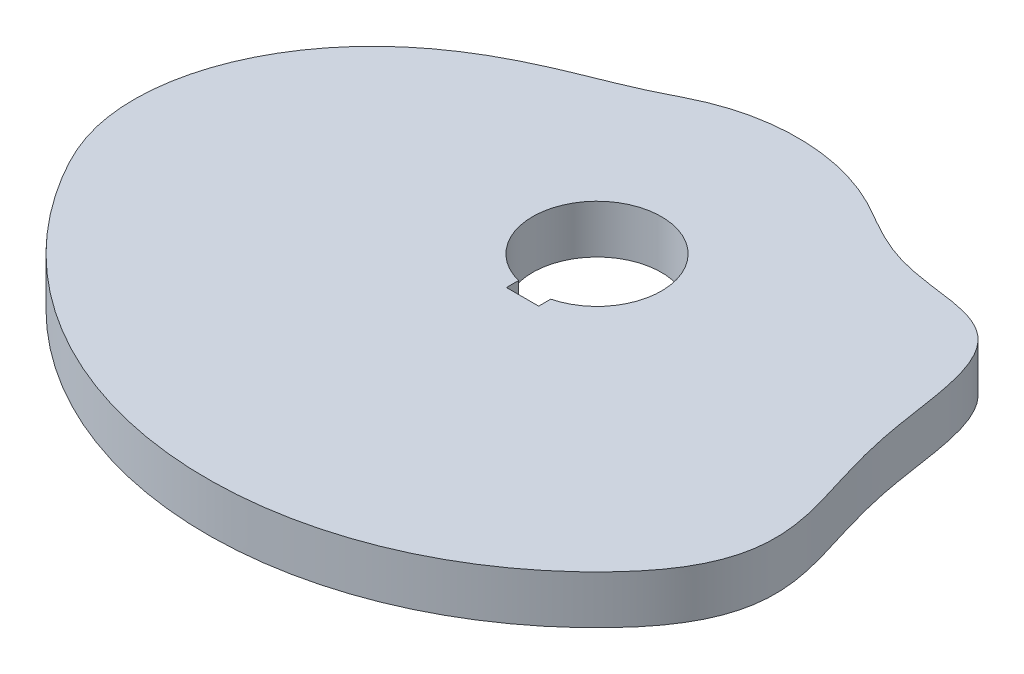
ISO-10303-21;
HEADER;
FILE_DESCRIPTION(('STEP AP214'),'2;1');
FILE_NAME('part.step','',(''),(''),'','','');
FILE_SCHEMA(('AUTOMOTIVE_DESIGN { 1 0 10303 214 1 1 1 1 }'));
ENDSEC;
DATA;
#1=APPLICATION_CONTEXT('core data for automotive mechanical design processes');
#2=APPLICATION_PROTOCOL_DEFINITION('international standard','automotive_design',2000,#1);
#3=PRODUCT_CONTEXT('',#1,'mechanical');
#4=PRODUCT('Part','Part','',(#3));
#5=PRODUCT_RELATED_PRODUCT_CATEGORY('part','',(#4));
#6=PRODUCT_DEFINITION_FORMATION('','',#4);
#7=PRODUCT_DEFINITION_CONTEXT('part definition',#1,'design');
#8=PRODUCT_DEFINITION('design','',#6,#7);
#9=PRODUCT_DEFINITION_SHAPE('','',#8);
#10=(LENGTH_UNIT() NAMED_UNIT(*) SI_UNIT(.MILLI.,.METRE.));
#11=(NAMED_UNIT(*) PLANE_ANGLE_UNIT() SI_UNIT($,.RADIAN.));
#12=(NAMED_UNIT(*) SI_UNIT($,.STERADIAN.) SOLID_ANGLE_UNIT());
#13=UNCERTAINTY_MEASURE_WITH_UNIT(LENGTH_MEASURE(1.E-05),#10,'distance_accuracy_value','');
#14=(GEOMETRIC_REPRESENTATION_CONTEXT(3) GLOBAL_UNCERTAINTY_ASSIGNED_CONTEXT((#13)) GLOBAL_UNIT_ASSIGNED_CONTEXT((#10,
#11,#12)) REPRESENTATION_CONTEXT('',''));
#15=CARTESIAN_POINT('',(0.,0.,0.));
#16=DIRECTION('',(0.,0.,1.));
#17=DIRECTION('',(1.,0.,0.));
#18=AXIS2_PLACEMENT_3D('',#15,#16,#17);
#19=CARTESIAN_POINT('',(0.,-19.05,0.));
#20=DIRECTION('',(0.,1.,0.));
#21=DIRECTION('',(0.,0.,1.));
#22=AXIS2_PLACEMENT_3D('',#19,#20,#21);
#23=PLANE('',#22);
#24=DIRECTION('',(1.,0.,0.));
#25=VECTOR('',#24,1.);
#26=CARTESIAN_POINT('',(-6.35000000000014,-19.05,29.355944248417));
#27=LINE('',#26,#25);
#28=CARTESIAN_POINT('',(-6.35000000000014,-19.05,29.355944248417));
#29=VERTEX_POINT('',#28);
#30=CARTESIAN_POINT('',(6.34999999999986,-19.05,29.3559442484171));
#31=VERTEX_POINT('',#30);
#32=EDGE_CURVE('E85',#29,#31,#27,.T.);
#33=ORIENTED_EDGE('',*,*,#32,.T.);
#34=DIRECTION('',(0.,0.,-1.));
#35=VECTOR('',#34,1.);
#36=CARTESIAN_POINT('',(6.34999999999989,-19.05,24.5934442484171));
#37=LINE('',#36,#35);
#38=CARTESIAN_POINT('',(6.34999999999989,-19.05,24.5934442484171));
#39=VERTEX_POINT('',#38);
#40=EDGE_CURVE('E88',#31,#39,#37,.T.);
#41=ORIENTED_EDGE('',*,*,#40,.T.);
#42=CARTESIAN_POINT('',(0.,-19.05,0.));
#43=DIRECTION('',(0.,1.,0.));
#44=DIRECTION('',(0.,0.,1.));
#45=AXIS2_PLACEMENT_3D('',#42,#43,#44);
#46=CIRCLE('',#45,25.4);
#47=CARTESIAN_POINT('',(-6.35000000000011,-19.05,24.5934442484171));
#48=VERTEX_POINT('',#47);
#49=EDGE_CURVE('E11',#39,#48,#46,.T.);
#50=ORIENTED_EDGE('',*,*,#49,.T.);
#51=DIRECTION('',(0.,0.,1.));
#52=VECTOR('',#51,1.);
#53=CARTESIAN_POINT('',(-6.35000000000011,-19.05,24.5934442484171));
#54=LINE('',#53,#52);
#55=EDGE_CURVE('E46',#48,#29,#54,.T.);
#56=ORIENTED_EDGE('',*,*,#55,.T.);
#57=EDGE_LOOP('',(#33,#41,#50,#56));
#58=FACE_BOUND('',#57,.T.);
#59=CARTESIAN_POINT('',(114.05419822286,-19.05,-24.3027912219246));
#60=CARTESIAN_POINT('',(113.900836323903,-19.05,-25.0225348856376));
#61=CARTESIAN_POINT('',(113.599117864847,-19.05,-26.3756390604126));
#62=CARTESIAN_POINT('',(113.116798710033,-19.05,-28.33512063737));
#63=CARTESIAN_POINT('',(112.620093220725,-19.05,-30.162893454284));
#64=CARTESIAN_POINT('',(112.09103536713,-19.05,-31.9203190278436));
#65=CARTESIAN_POINT('',(111.528659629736,-19.05,-33.6032549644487));
#66=CARTESIAN_POINT('',(110.932781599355,-19.05,-35.20799917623));
#67=CARTESIAN_POINT('',(110.303920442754,-19.05,-36.7314802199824));
#68=CARTESIAN_POINT('',(109.643177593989,-19.05,-38.1714455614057));
#69=CARTESIAN_POINT('',(108.952067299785,-19.05,-39.5266332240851));
#70=CARTESIAN_POINT('',(108.232302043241,-19.05,-40.7969074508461));
#71=CARTESIAN_POINT('',(107.48554173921,-19.05,-41.9833381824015));
#72=CARTESIAN_POINT('',(106.713123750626,-19.05,-43.0882053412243));
#73=CARTESIAN_POINT('',(105.915798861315,-19.05,-44.1149140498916));
#74=CARTESIAN_POINT('',(105.093504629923,-19.05,-45.0678163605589));
#75=CARTESIAN_POINT('',(104.245209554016,-19.05,-45.9519482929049));
#76=CARTESIAN_POINT('',(103.368857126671,-19.05,-46.7727058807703));
#77=CARTESIAN_POINT('',(102.461427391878,-19.05,-47.5354971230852));
#78=CARTESIAN_POINT('',(101.519116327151,-19.05,-48.2454143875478));
#79=CARTESIAN_POINT('',(100.537613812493,-19.05,-48.9069710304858));
#80=CARTESIAN_POINT('',(99.5124438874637,-19.05,-49.5239361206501));
#81=CARTESIAN_POINT('',(98.4393209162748,-19.05,-50.0992843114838));
#82=CARTESIAN_POINT('',(97.3144746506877,-19.05,-50.6352583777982));
#83=CARTESIAN_POINT('',(96.1349056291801,-19.05,-51.133524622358));
#84=CARTESIAN_POINT('',(94.8985469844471,-19.05,-51.5953900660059));
#85=CARTESIAN_POINT('',(93.6043254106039,-19.05,-52.0220466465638));
#86=CARTESIAN_POINT('',(92.2521289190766,-19.05,-52.4148108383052));
#87=CARTESIAN_POINT('',(90.8426996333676,-19.05,-52.7753348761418));
#88=CARTESIAN_POINT('',(89.3774755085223,-19.05,-53.1057753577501));
#89=CARTESIAN_POINT('',(87.8584061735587,-19.05,-53.4089140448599));
#90=CARTESIAN_POINT('',(86.2877664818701,-19.05,-53.688232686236));
#91=CARTESIAN_POINT('',(84.6679883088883,-19.05,-53.9479479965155));
#92=CARTESIAN_POINT('',(83.0015278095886,-19.05,-54.1930145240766));
#93=CARTESIAN_POINT('',(81.2907823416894,-19.05,-54.4291023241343));
#94=CARTESIAN_POINT('',(79.538068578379,-19.05,-54.6625535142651));
#95=CARTESIAN_POINT('',(77.745670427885,-19.05,-54.9003173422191));
#96=CARTESIAN_POINT('',(75.9159612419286,-19.05,-55.1498578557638));
#97=CARTESIAN_POINT('',(74.0515981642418,-19.05,-55.4190224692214));
#98=CARTESIAN_POINT('',(72.1557761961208,-19.05,-55.715855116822));
#99=CARTESIAN_POINT('',(70.2325152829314,-19.05,-56.0483365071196));
#100=CARTESIAN_POINT('',(68.2869368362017,-19.05,-56.4240390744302));
#101=CARTESIAN_POINT('',(66.325470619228,-19.05,-56.8496980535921));
#102=CARTESIAN_POINT('',(64.3559255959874,-19.05,-57.330723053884));
#103=CARTESIAN_POINT('',(62.3873669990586,-19.05,-57.870702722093));
#104=CARTESIAN_POINT('',(60.4297715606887,-19.05,-58.4709795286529));
#105=CARTESIAN_POINT('',(58.4934810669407,-19.05,-59.1303802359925));
#106=CARTESIAN_POINT('',(56.5885285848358,-19.05,-59.8451706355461));
#107=CARTESIAN_POINT('',(54.7239524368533,-19.05,-60.6092605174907));
#108=CARTESIAN_POINT('',(52.9072228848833,-19.05,-61.4146289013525));
#109=CARTESIAN_POINT('',(51.1438800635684,-19.05,-62.2518906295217));
#110=CARTESIAN_POINT('',(49.4374291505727,-19.05,-63.110901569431));
#111=CARTESIAN_POINT('',(47.7894802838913,-19.05,-63.9813070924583));
#112=CARTESIAN_POINT('',(46.2000762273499,-19.05,-64.8529704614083));
#113=CARTESIAN_POINT('',(44.6681293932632,-19.05,-65.7162571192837));
#114=CARTESIAN_POINT('',(43.1918942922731,-19.05,-66.5621903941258));
#115=CARTESIAN_POINT('',(41.7694099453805,-19.05,-67.3825002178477));
#116=CARTESIAN_POINT('',(40.3988976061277,-19.05,-68.1696491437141));
#117=CARTESIAN_POINT('',(39.0790149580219,-19.05,-68.9167214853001));
#118=CARTESIAN_POINT('',(37.8066361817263,-19.05,-69.6191790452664));
#119=CARTESIAN_POINT('',(36.5630715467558,-19.05,-70.2805490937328));
#120=CARTESIAN_POINT('',(35.3282372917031,-19.05,-70.9091382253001));
#121=CARTESIAN_POINT('',(34.0853367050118,-19.05,-71.5149303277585));
#122=CARTESIAN_POINT('',(32.8320336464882,-19.05,-72.0989015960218));
#123=CARTESIAN_POINT('',(31.5687349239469,-19.05,-72.6609206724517));
#124=CARTESIAN_POINT('',(30.2958186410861,-19.05,-73.2008038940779));
#125=CARTESIAN_POINT('',(29.0136743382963,-19.05,-73.718390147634));
#126=CARTESIAN_POINT('',(27.7226920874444,-19.05,-74.2135208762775));
#127=CARTESIAN_POINT('',(26.4232652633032,-19.05,-74.6860454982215));
#128=CARTESIAN_POINT('',(25.1157896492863,-19.05,-75.1358200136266));
#129=CARTESIAN_POINT('',(23.8006635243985,-19.05,-75.5627074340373));
#130=CARTESIAN_POINT('',(22.4782874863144,-19.05,-75.9665777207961));
#131=CARTESIAN_POINT('',(21.1490643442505,-19.05,-76.3473078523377));
#132=CARTESIAN_POINT('',(19.8133989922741,-19.05,-76.7047818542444));
#133=CARTESIAN_POINT('',(18.471698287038,-19.05,-77.0388908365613));
#134=CARTESIAN_POINT('',(17.1243709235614,-19.05,-77.3495330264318));
#135=CARTESIAN_POINT('',(15.7718273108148,-19.05,-77.6366137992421));
#136=CARTESIAN_POINT('',(14.4144794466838,-19.05,-77.900045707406));
#137=CARTESIAN_POINT('',(13.0527407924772,-19.05,-78.1397485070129));
#138=CARTESIAN_POINT('',(11.6870261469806,-19.05,-78.3556491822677));
#139=CARTESIAN_POINT('',(10.3177515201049,-19.05,-78.5476819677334));
#140=CARTESIAN_POINT('',(8.94533400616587,-19.05,-78.7157883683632));
#141=CARTESIAN_POINT('',(7.57019165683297,-19.05,-78.8599171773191));
#142=CARTESIAN_POINT('',(6.19274335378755,-19.05,-78.9800244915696));
#143=CARTESIAN_POINT('',(4.81340868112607,-19.05,-79.0760737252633));
#144=CARTESIAN_POINT('',(3.43260779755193,-19.05,-79.1480356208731));
#145=CARTESIAN_POINT('',(2.05076130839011,-19.05,-79.1958882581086));
#146=CARTESIAN_POINT('',(0.668290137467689,-19.05,-79.2196170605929));
#147=CARTESIAN_POINT('',(-0.714384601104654,-19.05,-79.2192148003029));
#148=CARTESIAN_POINT('',(-2.09684173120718,-19.05,-79.1946815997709));
#149=CARTESIAN_POINT('',(-3.47866014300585,-19.05,-79.1460249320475));
#150=CARTESIAN_POINT('',(-4.85941892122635,-19.05,-79.073259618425));
#151=CARTESIAN_POINT('',(-6.23869747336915,-19.05,-78.9764078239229));
#152=CARTESIAN_POINT('',(-7.6160756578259,-19.05,-78.855499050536));
#153=CARTESIAN_POINT('',(-8.99113391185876,-19.05,-78.710570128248));
#154=CARTESIAN_POINT('',(-10.3634533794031,-19.05,-78.5416652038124));
#155=CARTESIAN_POINT('',(-11.7326160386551,-19.05,-78.3488357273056));
#156=CARTESIAN_POINT('',(-13.0982048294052,-19.05,-78.132140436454));
#157=CARTESIAN_POINT('',(-14.4598037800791,-19.05,-77.8916453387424));
#158=CARTESIAN_POINT('',(-15.816998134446,-19.05,-77.6274236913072));
#159=CARTESIAN_POINT('',(-17.169374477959,-19.05,-77.3395559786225));
#160=CARTESIAN_POINT('',(-18.5165208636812,-19.05,-77.0281298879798));
#161=CARTESIAN_POINT('',(-19.8580269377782,-19.05,-76.6932402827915));
#162=CARTESIAN_POINT('',(-21.193484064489,-19.05,-76.3349891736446));
#163=CARTESIAN_POINT('',(-22.5224854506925,-19.05,-75.9534856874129));
#164=CARTESIAN_POINT('',(-23.8446262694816,-19.05,-75.5488460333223));
#165=CARTESIAN_POINT('',(-25.1595037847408,-19.05,-75.1211934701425));
#166=CARTESIAN_POINT('',(-26.4667174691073,-19.05,-74.6706582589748));
#167=CARTESIAN_POINT('',(-27.7658691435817,-19.05,-74.1973776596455));
#168=CARTESIAN_POINT('',(-29.0565630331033,-19.05,-73.701495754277));
#169=CARTESIAN_POINT('',(-30.3384061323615,-19.05,-73.1831639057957));
#170=CARTESIAN_POINT('',(-31.6110074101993,-19.05,-72.6425388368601));
#171=CARTESIAN_POINT('',(-32.8318831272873,-19.05,-72.0985474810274));
#172=CARTESIAN_POINT('',(-34.103423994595,-19.05,-71.5065066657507));
#173=CARTESIAN_POINT('',(-35.412060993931,-19.05,-70.8686269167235));
#174=CARTESIAN_POINT('',(-36.8314355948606,-19.05,-70.1573077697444));
#175=CARTESIAN_POINT('',(-38.2923601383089,-19.05,-69.4163317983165));
#176=CARTESIAN_POINT('',(-39.8348909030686,-19.05,-68.634709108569));
#177=CARTESIAN_POINT('',(-41.4552905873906,-19.05,-67.8233044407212));
#178=CARTESIAN_POINT('',(-43.1475203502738,-19.05,-66.9931861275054));
#179=CARTESIAN_POINT('',(-44.9036203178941,-19.05,-66.1545226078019));
#180=CARTESIAN_POINT('',(-46.7143577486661,-19.05,-65.3158802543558));
#181=CARTESIAN_POINT('',(-48.5696957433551,-19.05,-64.482871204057));
#182=CARTESIAN_POINT('',(-50.4609568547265,-19.05,-63.6604075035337));
#183=CARTESIAN_POINT('',(-52.3807143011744,-19.05,-62.8453402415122));
#184=CARTESIAN_POINT('',(-54.3269500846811,-19.05,-62.0364837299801));
#185=CARTESIAN_POINT('',(-56.2996953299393,-19.05,-61.2291271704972));
#186=CARTESIAN_POINT('',(-58.2995127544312,-19.05,-60.4189176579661));
#187=CARTESIAN_POINT('',(-60.3268981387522,-19.05,-59.6012700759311));
#188=CARTESIAN_POINT('',(-62.3822931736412,-19.05,-58.7716072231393));
#189=CARTESIAN_POINT('',(-64.4659956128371,-19.05,-57.9253396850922));
#190=CARTESIAN_POINT('',(-66.5781082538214,-19.05,-57.0579087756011));
#191=CARTESIAN_POINT('',(-68.7184890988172,-19.05,-56.164806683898));
#192=CARTESIAN_POINT('',(-70.8867130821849,-19.05,-55.2415993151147));
#193=CARTESIAN_POINT('',(-73.0820420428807,-19.05,-54.2839464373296));
#194=CARTESIAN_POINT('',(-75.3034030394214,-19.05,-53.2876217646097));
#195=CARTESIAN_POINT('',(-77.5493740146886,-19.05,-52.2485330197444));
#196=CARTESIAN_POINT('',(-79.818176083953,-19.05,-51.1627424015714));
#197=CARTESIAN_POINT('',(-82.1076716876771,-19.05,-50.0264875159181));
#198=CARTESIAN_POINT('',(-84.4153679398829,-19.05,-48.8362027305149));
#199=CARTESIAN_POINT('',(-86.7384245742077,-19.05,-47.5885407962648));
#200=CARTESIAN_POINT('',(-89.0736659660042,-19.05,-46.2803945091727));
#201=CARTESIAN_POINT('',(-91.4175967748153,-19.05,-44.9089181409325));
#202=CARTESIAN_POINT('',(-93.7664208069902,-19.05,-43.4715483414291));
#203=CARTESIAN_POINT('',(-96.1160627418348,-19.05,-41.9660242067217));
#204=CARTESIAN_POINT('',(-98.4621923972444,-19.05,-40.3904062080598));
#205=CARTESIAN_POINT('',(-100.800251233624,-19.05,-38.7430936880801));
#206=CARTESIAN_POINT('',(-103.125480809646,-19.05,-37.0228406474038));
#207=CARTESIAN_POINT('',(-105.4329529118,-19.05,-35.2287695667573));
#208=CARTESIAN_POINT('',(-107.71760108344,-19.05,-33.360383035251));
#209=CARTESIAN_POINT('',(-109.974253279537,-19.05,-31.4175729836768));
#210=CARTESIAN_POINT('',(-112.19766537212,-19.05,-29.4006273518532));
#211=CARTESIAN_POINT('',(-114.38255522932,-19.05,-27.3102340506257));
#212=CARTESIAN_POINT('',(-116.523637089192,-19.05,-25.1474821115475));
#213=CARTESIAN_POINT('',(-118.615655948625,-19.05,-22.9138599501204));
#214=CARTESIAN_POINT('',(-120.653421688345,-19.05,-20.6112507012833));
#215=CARTESIAN_POINT('',(-122.631842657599,-19.05,-18.241924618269));
#216=CARTESIAN_POINT('',(-124.5459584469,-19.05,-15.8085285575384));
#217=CARTESIAN_POINT('',(-126.390971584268,-19.05,-13.3140726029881));
#218=CARTESIAN_POINT('',(-128.162277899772,-19.05,-10.7619139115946));
#219=CARTESIAN_POINT('',(-129.855495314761,-19.05,-8.15573788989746));
#220=CARTESIAN_POINT('',(-131.466490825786,-19.05,-5.49953683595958));
#221=CARTESIAN_POINT('',(-132.991405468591,-19.05,-2.79758620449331));
#222=CARTESIAN_POINT('',(-134.426677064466,-19.05,-0.0544186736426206));
#223=CARTESIAN_POINT('',(-135.769060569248,-19.05,2.72520378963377));
#224=CARTESIAN_POINT('',(-137.015645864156,-19.05,5.53631965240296));
#225=CARTESIAN_POINT('',(-138.163872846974,-19.05,8.37379909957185));
#226=CARTESIAN_POINT('',(-139.211543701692,-19.05,11.2323766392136));
#227=CARTESIAN_POINT('',(-140.156832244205,-19.05,14.1066847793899));
#228=CARTESIAN_POINT('',(-140.998290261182,-19.05,16.9912885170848));
#229=CARTESIAN_POINT('',(-141.734850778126,-19.05,19.8807203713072));
#230=CARTESIAN_POINT('',(-142.36582821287,-19.05,22.7695156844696));
#231=CARTESIAN_POINT('',(-142.890915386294,-19.05,25.6522479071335));
#232=CARTESIAN_POINT('',(-143.31017739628,-19.05,28.5235635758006));
#233=CARTESIAN_POINT('',(-143.624042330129,-19.05,31.378216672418));
#234=CARTESIAN_POINT('',(-143.833289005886,-19.05,34.2111020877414));
#235=CARTESIAN_POINT('',(-143.939031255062,-19.05,37.0172877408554));
#236=CARTESIAN_POINT('',(-143.942700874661,-19.05,39.7920454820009));
#237=CARTESIAN_POINT('',(-143.846021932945,-19.05,42.5308787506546));
#238=CARTESIAN_POINT('',(-143.651003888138,-19.05,45.2295528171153));
#239=CARTESIAN_POINT('',(-143.359853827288,-19.05,47.8841046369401));
#240=CARTESIAN_POINT('',(-142.975173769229,-19.05,50.4909147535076));
#241=CARTESIAN_POINT('',(-142.499074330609,-19.05,53.0467058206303));
#242=CARTESIAN_POINT('',(-141.935984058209,-19.05,55.549865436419));
#243=CARTESIAN_POINT('',(-141.284866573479,-19.05,58.0005972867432));
#244=CARTESIAN_POINT('',(-140.549287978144,-19.05,60.4033257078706));
#245=CARTESIAN_POINT('',(-139.730164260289,-19.05,62.7647202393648));
#246=CARTESIAN_POINT('',(-138.828934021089,-19.05,65.0926490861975));
#247=CARTESIAN_POINT('',(-137.84682713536,-19.05,67.3957415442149));
#248=CARTESIAN_POINT('',(-136.785205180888,-19.05,69.6830825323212));
#249=CARTESIAN_POINT('',(-135.645669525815,-19.05,71.963847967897));
#250=CARTESIAN_POINT('',(-134.4303800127,-19.05,74.2470627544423));
#251=CARTESIAN_POINT('',(-133.142964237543,-19.05,76.539171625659));
#252=CARTESIAN_POINT('',(-131.796369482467,-19.05,78.8343644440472));
#253=CARTESIAN_POINT('',(-130.401763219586,-19.05,81.1207730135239));
#254=CARTESIAN_POINT('',(-128.966109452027,-19.05,83.3842182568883));
#255=CARTESIAN_POINT('',(-127.491222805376,-19.05,85.6222938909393));
#256=CARTESIAN_POINT('',(-125.977487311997,-19.05,87.8342800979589));
#257=CARTESIAN_POINT('',(-124.425381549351,-19.05,90.019513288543));
#258=CARTESIAN_POINT('',(-122.835373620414,-19.05,92.177325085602));
#259=CARTESIAN_POINT('',(-121.207949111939,-19.05,94.307058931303));
#260=CARTESIAN_POINT('',(-119.543603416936,-19.05,96.4080658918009));
#261=CARTESIAN_POINT('',(-117.842843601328,-19.05,98.4797060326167));
#262=CARTESIAN_POINT('',(-116.106187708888,-19.05,100.521348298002));
#263=CARTESIAN_POINT('',(-114.334164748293,-19.05,102.532370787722));
#264=CARTESIAN_POINT('',(-112.52731449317,-19.05,104.512160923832));
#265=CARTESIAN_POINT('',(-110.686187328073,-19.05,106.460115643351));
#266=CARTESIAN_POINT('',(-108.811344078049,-19.05,108.375641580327));
#267=CARTESIAN_POINT('',(-106.903355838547,-19.05,110.258155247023));
#268=CARTESIAN_POINT('',(-104.962803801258,-19.05,112.107083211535));
#269=CARTESIAN_POINT('',(-102.990279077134,-19.05,113.921862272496));
#270=CARTESIAN_POINT('',(-100.986382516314,-19.05,115.701939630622));
#271=CARTESIAN_POINT('',(-98.9517245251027,-19.05,117.446773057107));
#272=CARTESIAN_POINT('',(-96.8869248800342,-19.05,119.155831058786));
#273=CARTESIAN_POINT('',(-94.7926125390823,-19.05,120.828593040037));
#274=CARTESIAN_POINT('',(-92.6694254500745,-19.05,122.464549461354));
#275=CARTESIAN_POINT('',(-90.5180103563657,-19.05,124.063201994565));
#276=CARTESIAN_POINT('',(-88.3390225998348,-19.05,125.624063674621));
#277=CARTESIAN_POINT('',(-86.1331259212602,-19.05,127.146659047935));
#278=CARTESIAN_POINT('',(-83.9009922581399,-19.05,128.630524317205));
#279=CARTESIAN_POINT('',(-81.6433015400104,-19.05,130.075207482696));
#280=CARTESIAN_POINT('',(-79.3607414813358,-19.05,131.480268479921));
#281=CARTESIAN_POINT('',(-77.0540073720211,-19.05,132.845279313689));
#282=CARTESIAN_POINT('',(-74.7238018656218,-19.05,134.169824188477));
#283=CARTESIAN_POINT('',(-72.3708347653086,-19.05,135.453499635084));
#284=CARTESIAN_POINT('',(-69.9958228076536,-19.05,136.695914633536));
#285=CARTESIAN_POINT('',(-67.5994894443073,-19.05,137.896690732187));
#286=CARTESIAN_POINT('',(-65.182564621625,-19.05,139.055462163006));
#287=CARTESIAN_POINT('',(-62.7457845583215,-19.05,140.171875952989));
#288=CARTESIAN_POINT('',(-60.2898915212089,-19.05,141.245592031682));
#289=CARTESIAN_POINT('',(-57.8156335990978,-19.05,142.276283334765));
#290=CARTESIAN_POINT('',(-55.3237644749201,-19.05,143.263635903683));
#291=CARTESIAN_POINT('',(-52.8150431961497,-19.05,144.207348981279));
#292=CARTESIAN_POINT('',(-50.2902339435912,-19.05,145.107135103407));
#293=CARTESIAN_POINT('',(-47.7501057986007,-19.05,145.962720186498));
#294=CARTESIAN_POINT('',(-45.1954325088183,-19.05,146.773843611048));
#295=CARTESIAN_POINT('',(-42.6269922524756,-19.05,147.540258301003));
#296=CARTESIAN_POINT('',(-40.0455674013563,-19.05,148.261730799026));
#297=CARTESIAN_POINT('',(-37.4519442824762,-19.05,148.938041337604));
#298=CARTESIAN_POINT('',(-34.8469129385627,-19.05,149.568983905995));
#299=CARTESIAN_POINT('',(-32.2312668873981,-19.05,150.15436631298));
#300=CARTESIAN_POINT('',(-29.6058028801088,-19.05,150.694010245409));
#301=CARTESIAN_POINT('',(-26.971320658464,-19.05,151.187751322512));
#302=CARTESIAN_POINT('',(-24.3286227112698,-19.05,151.635439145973));
#303=CARTESIAN_POINT('',(-21.6785140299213,-19.05,152.036937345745));
#304=CARTESIAN_POINT('',(-19.0218018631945,-19.05,152.392123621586));
#305=CARTESIAN_POINT('',(-16.3592954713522,-19.05,152.700889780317));
#306=CARTESIAN_POINT('',(-13.6918058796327,-19.05,152.963141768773));
#307=CARTESIAN_POINT('',(-11.0201456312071,-19.05,153.17879970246));
#308=CARTESIAN_POINT('',(-8.34512853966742,-19.05,153.347797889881));
#309=CARTESIAN_POINT('',(-5.66756944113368,-19.05,153.470084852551));
#310=CARTESIAN_POINT('',(-2.98828394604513,-19.05,153.545623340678));
#311=CARTESIAN_POINT('',(-0.308088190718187,-19.05,153.574390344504));
#312=CARTESIAN_POINT('',(2.37220141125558,-19.05,153.556377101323));
#313=CARTESIAN_POINT('',(5.05176841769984,-19.05,153.491589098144));
#314=CARTESIAN_POINT('',(7.729796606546,-19.05,153.380046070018));
#315=CARTESIAN_POINT('',(10.4054702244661,-19.05,153.221781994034));
#316=CARTESIAN_POINT('',(13.0779742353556,-19.05,153.016845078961));
#317=CARTESIAN_POINT('',(15.7464945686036,-19.05,152.76529775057));
#318=CARTESIAN_POINT('',(18.4102183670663,-19.05,152.467216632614));
#319=CARTESIAN_POINT('',(21.0683342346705,-19.05,152.122692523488));
#320=CARTESIAN_POINT('',(23.720032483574,-19.05,151.731830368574));
#321=CARTESIAN_POINT('',(26.3645053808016,-19.05,151.29474922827));
#322=CARTESIAN_POINT('',(29.0009473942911,-19.05,150.811582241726));
#323=CARTESIAN_POINT('',(31.6285554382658,-19.05,150.282476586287));
#324=CARTESIAN_POINT('',(34.2465291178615,-19.05,149.707593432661));
#325=CARTESIAN_POINT('',(36.8540709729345,-19.05,149.087107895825));
#326=CARTESIAN_POINT('',(39.4503867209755,-19.05,148.421208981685));
#327=CARTESIAN_POINT('',(42.034685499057,-19.05,147.7100995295));
#328=CARTESIAN_POINT('',(44.6061801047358,-19.05,146.953996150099));
#329=CARTESIAN_POINT('',(47.1640872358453,-19.05,146.153129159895));
#330=CARTESIAN_POINT('',(49.7076277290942,-19.05,145.307742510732));
#331=CARTESIAN_POINT('',(52.236026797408,-19.05,144.418093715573));
#332=CARTESIAN_POINT('',(54.7485142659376,-19.05,143.484453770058));
#333=CARTESIAN_POINT('',(57.2443248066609,-19.05,142.50710706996));
#334=CARTESIAN_POINT('',(59.72269817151,-19.05,141.48635132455));
#335=CARTESIAN_POINT('',(62.1828794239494,-19.05,140.422497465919));
#336=CARTESIAN_POINT('',(64.6241191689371,-19.05,139.315869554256));
#337=CARTESIAN_POINT('',(67.0456737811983,-19.05,138.166804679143));
#338=CARTESIAN_POINT('',(69.4468056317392,-19.05,136.975652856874));
#339=CARTESIAN_POINT('',(71.8267833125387,-19.05,135.742776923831));
#340=CARTESIAN_POINT('',(74.1848818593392,-19.05,134.468552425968));
#341=CARTESIAN_POINT('',(76.5203829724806,-19.05,133.153367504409));
#342=CARTESIAN_POINT('',(78.8325752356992,-19.05,131.797622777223));
#343=CARTESIAN_POINT('',(81.1207543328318,-19.05,130.401731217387));
#344=CARTESIAN_POINT('',(83.3842232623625,-19.05,128.966118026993));
#345=CARTESIAN_POINT('',(85.6222925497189,-19.05,127.49122050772));
#346=CARTESIAN_POINT('',(87.8342804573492,-19.05,125.977487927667));
#347=CARTESIAN_POINT('',(90.0195131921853,-19.05,124.425381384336));
#348=CARTESIAN_POINT('',(92.1773251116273,-19.05,122.835373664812));
#349=CARTESIAN_POINT('',(94.3070589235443,-19.05,121.207949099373));
#350=CARTESIAN_POINT('',(96.4080658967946,-19.05,119.543603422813));
#351=CARTESIAN_POINT('',(98.4797060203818,-19.05,117.8428435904));
#352=CARTESIAN_POINT('',(100.521348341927,-19.05,116.106187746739));
#353=CARTESIAN_POINT('',(102.532370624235,-19.05,114.334164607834));
#354=CARTESIAN_POINT('',(104.512161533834,-19.05,112.527315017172));
#355=CARTESIAN_POINT('',(106.46011336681,-19.05,110.686185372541));
#356=CARTESIAN_POINT('',(108.375650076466,-19.05,108.811351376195));
#357=CARTESIAN_POINT('',(110.25506573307,-19.05,106.906427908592));
#358=CARTESIAN_POINT('',(112.090514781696,-19.05,104.980470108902));
#359=CARTESIAN_POINT('',(113.870058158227,-19.05,103.039995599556));
#360=CARTESIAN_POINT('',(115.584293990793,-19.05,101.089442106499));
#361=CARTESIAN_POINT('',(117.228285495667,-19.05,99.1294715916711));
#362=CARTESIAN_POINT('',(118.797451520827,-19.05,97.1610581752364));
#363=CARTESIAN_POINT('',(120.287630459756,-19.05,95.185526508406));
#364=CARTESIAN_POINT('',(121.695141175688,-19.05,93.2044831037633));
#365=CARTESIAN_POINT('',(123.016847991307,-19.05,91.2197435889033));
#366=CARTESIAN_POINT('',(124.250211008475,-19.05,89.2332447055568));
#367=CARTESIAN_POINT('',(125.393322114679,-19.05,87.2469474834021));
#368=CARTESIAN_POINT('',(126.444922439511,-19.05,85.2627346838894));
#369=CARTESIAN_POINT('',(127.404399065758,-19.05,83.2823077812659));
#370=CARTESIAN_POINT('',(128.271759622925,-19.05,81.3070893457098));
#371=CARTESIAN_POINT('',(129.047585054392,-19.05,79.3381373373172));
#372=CARTESIAN_POINT('',(129.732962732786,-19.05,77.3760778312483));
#373=CARTESIAN_POINT('',(130.329404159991,-19.05,75.4210620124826));
#374=CARTESIAN_POINT('',(130.838753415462,-19.05,73.4727517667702));
#375=CARTESIAN_POINT('',(131.263093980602,-19.05,71.5303358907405));
#376=CARTESIAN_POINT('',(131.604662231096,-19.05,69.5925760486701));
#377=CARTESIAN_POINT('',(131.865775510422,-19.05,67.6578784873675));
#378=CARTESIAN_POINT('',(132.048781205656,-19.05,65.7243846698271));
#379=CARTESIAN_POINT('',(132.156030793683,-19.05,63.7900719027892));
#380=CARTESIAN_POINT('',(132.189879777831,-19.05,61.8528541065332));
#381=CARTESIAN_POINT('',(132.152711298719,-19.05,59.9106732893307));
#382=CARTESIAN_POINT('',(132.04697850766,-19.05,57.9615739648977));
#383=CARTESIAN_POINT('',(131.875258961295,-19.05,56.0037553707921));
#384=CARTESIAN_POINT('',(131.640313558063,-19.05,54.0355994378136));
#385=CARTESIAN_POINT('',(131.345142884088,-19.05,52.0556755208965));
#386=CARTESIAN_POINT('',(130.993035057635,-19.05,50.0627255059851));
#387=CARTESIAN_POINT('',(130.587600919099,-19.05,48.055634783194));
#388=CARTESIAN_POINT('',(130.132794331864,-19.05,46.0333956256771));
#389=CARTESIAN_POINT('',(129.63291710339,-19.05,43.9950697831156));
#390=CARTESIAN_POINT('',(129.092609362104,-19.05,41.9397567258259));
#391=CARTESIAN_POINT('',(128.516826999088,-19.05,39.8665731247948));
#392=CARTESIAN_POINT('',(127.910807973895,-19.05,37.7746479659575));
#393=CARTESIAN_POINT('',(127.28002894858,-19.05,35.6631362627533));
#394=CARTESIAN_POINT('',(126.630152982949,-19.05,33.5312526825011));
#395=CARTESIAN_POINT('',(125.966968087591,-19.05,31.3783245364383));
#396=CARTESIAN_POINT('',(125.296315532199,-19.05,29.2038615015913));
#397=CARTESIAN_POINT('',(124.62400622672,-19.05,27.0076372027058));
#398=CARTESIAN_POINT('',(123.95572352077,-19.05,24.7897755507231));
#399=CARTESIAN_POINT('',(123.296911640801,-19.05,22.5508328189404));
#400=CARTESIAN_POINT('',(122.652650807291,-19.05,20.2918652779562));
#401=CARTESIAN_POINT('',(122.027522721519,-19.05,18.0144722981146));
#402=CARTESIAN_POINT('',(121.42547317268,-19.05,15.7208065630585));
#403=CARTESIAN_POINT('',(120.849681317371,-19.05,13.4135465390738));
#404=CARTESIAN_POINT('',(120.302446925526,-19.05,11.0958312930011));
#405=CARTESIAN_POINT('',(119.785106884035,-19.05,8.77116334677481));
#406=CARTESIAN_POINT('',(119.297990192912,-19.05,6.44329035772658));
#407=CARTESIAN_POINT('',(118.840416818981,-19.05,4.1160798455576));
#408=CARTESIAN_POINT('',(118.41074085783,-19.05,1.79340211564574));
#409=CARTESIAN_POINT('',(118.006433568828,-19.05,-0.520965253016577));
#410=CARTESIAN_POINT('',(117.624198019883,-19.05,-2.82340199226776));
#411=CARTESIAN_POINT('',(117.260104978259,-19.05,-5.11047467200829));
#412=CARTESIAN_POINT('',(116.909739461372,-19.05,-7.37893232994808));
#413=CARTESIAN_POINT('',(116.568348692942,-19.05,-9.62567373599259));
#414=CARTESIAN_POINT('',(116.230984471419,-19.05,-11.8476946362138));
#415=CARTESIAN_POINT('',(115.892635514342,-19.05,-14.0420246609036));
#416=CARTESIAN_POINT('',(115.548347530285,-19.05,-16.2056628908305));
#417=CARTESIAN_POINT('',(115.193330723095,-19.05,-18.3355216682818));
#418=CARTESIAN_POINT('',(114.823054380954,-19.05,-20.4283800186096));
#419=CARTESIAN_POINT('',(114.445971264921,-19.05,-22.4143060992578));
#420=CARTESIAN_POINT('',(114.182577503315,-19.05,-23.7002936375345));
#421=CARTESIAN_POINT('',(114.05419822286,-19.05,-24.3027912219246));
#422=B_SPLINE_CURVE_WITH_KNOTS('',3,(#59,#60,#61,#62,#63,#64,#65,#66,#67,#68,#69,#70,#71,#72,
#73,#74,#75,#76,#77,#78,#79,#80,#81,#82,#83,#84,#85,#86,#87,#88,#89,#90,#91,#92,#93,#94,#95,#96,
#97,#98,#99,#100,#101,#102,#103,#104,#105,#106,#107,#108,#109,#110,#111,#112,#113,#114,#115,
#116,#117,#118,#119,#120,#121,#122,#123,#124,#125,#126,#127,#128,#129,#130,#131,#132,#133,#134,
#135,#136,#137,#138,#139,#140,#141,#142,#143,#144,#145,#146,#147,#148,#149,#150,#151,#152,#153,
#154,#155,#156,#157,#158,#159,#160,#161,#162,#163,#164,#165,#166,#167,#168,#169,#170,#171,#172,
#173,#174,#175,#176,#177,#178,#179,#180,#181,#182,#183,#184,#185,#186,#187,#188,#189,#190,#191,
#192,#193,#194,#195,#196,#197,#198,#199,#200,#201,#202,#203,#204,#205,#206,#207,#208,#209,#210,
#211,#212,#213,#214,#215,#216,#217,#218,#219,#220,#221,#222,#223,#224,#225,#226,#227,#228,#229,
#230,#231,#232,#233,#234,#235,#236,#237,#238,#239,#240,#241,#242,#243,#244,#245,#246,#247,#248,
#249,#250,#251,#252,#253,#254,#255,#256,#257,#258,#259,#260,#261,#262,#263,#264,#265,#266,#267,
#268,#269,#270,#271,#272,#273,#274,#275,#276,#277,#278,#279,#280,#281,#282,#283,#284,#285,#286,
#287,#288,#289,#290,#291,#292,#293,#294,#295,#296,#297,#298,#299,#300,#301,#302,#303,#304,#305,
#306,#307,#308,#309,#310,#311,#312,#313,#314,#315,#316,#317,#318,#319,#320,#321,#322,#323,#324,
#325,#326,#327,#328,#329,#330,#331,#332,#333,#334,#335,#336,#337,#338,#339,#340,#341,#342,#343,
#344,#345,#346,#347,#348,#349,#350,#351,#352,#353,#354,#355,#356,#357,#358,#359,#360,#361,#362,
#363,#364,#365,#366,#367,#368,#369,#370,#371,#372,#373,#374,#375,#376,#377,#378,#379,#380,#381,
#382,#383,#384,#385,#386,#387,#388,#389,#390,#391,#392,#393,#394,#395,#396,#397,#398,#399,#400,
#401,#402,#403,#404,#405,#406,#407,#408,#409,#410,#411,#412,#413,#414,#415,#416,#417,#418,#419,
#420,#421),.UNSPECIFIED.,.T.,.F.,(4,1,1,1,1,1,1,1,1,1,1,1,1,1,1,1,1,1,1,1,1,1,1,1,1,1,1,1,1,1,1,
1,1,1,1,1,1,1,1,1,1,1,1,1,1,1,1,1,1,1,1,1,1,1,1,1,1,1,1,1,1,1,1,1,1,1,1,1,1,1,1,1,1,1,1,1,1,1,1,
1,1,1,1,1,1,1,1,1,1,1,1,1,1,1,1,1,1,1,1,1,1,1,1,1,1,1,1,1,1,1,1,1,1,1,1,1,1,1,1,1,1,1,1,1,1,1,1,
1,1,1,1,1,1,1,1,1,1,1,1,1,1,1,1,1,1,1,1,1,1,1,1,1,1,1,1,1,1,1,1,1,1,1,1,1,1,1,1,1,1,1,1,1,1,1,1,
1,1,1,1,1,1,1,1,1,1,1,1,1,1,1,1,1,1,1,1,1,1,1,1,1,1,1,1,1,1,1,1,1,1,1,1,1,1,1,1,1,1,1,1,1,1,1,1,
1,1,1,1,1,1,1,1,1,1,1,1,1,1,1,1,1,1,1,1,1,1,1,1,1,1,1,1,1,1,1,1,1,1,1,1,1,1,1,1,1,1,1,1,1,1,1,1,
1,1,1,1,1,1,1,1,1,1,1,1,1,1,1,1,1,1,1,1,1,1,1,1,1,1,1,1,1,1,1,1,1,1,1,1,1,1,1,1,1,1,1,1,1,1,1,1,
1,1,1,1,1,1,1,1,1,1,1,1,1,1,1,1,1,1,1,1,1,1,1,1,1,1,1,1,1,1,1,1,1,1,1,1,1,1,1,1,1,4),(0.,
0.00275844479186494,0.00519620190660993,0.00756362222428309,0.00985745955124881,
0.0120749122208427,0.0142138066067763,0.0162727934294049,0.0182515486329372,0.0201509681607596,
0.0219733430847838,0.0237224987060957,0.0254038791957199,0.0270245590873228,0.0285931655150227,
0.0301197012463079,0.0316152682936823,0.033091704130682,0.0345611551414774,0.0360356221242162,
0.0375265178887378,0.039044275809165,0.0405980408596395,0.0421954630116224,0.0438425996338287,
0.04554392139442,0.0473024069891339,0.049119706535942,0.0509963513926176,0.0529319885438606,
0.0549256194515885,0.0569758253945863,0.0590809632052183,0.0612393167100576,0.0634491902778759,
0.0657089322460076,0.0680168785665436,0.0703712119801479,0.0727697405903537,0.0752096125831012,
0.0776870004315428,0.0801968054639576,0.0827324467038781,0.0852857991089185,0.0878473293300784,
0.0904064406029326,0.0929519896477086,0.0954728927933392,0.0979587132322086,0.100400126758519,
0.102789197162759,0.105119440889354,0.10738570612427,0.109583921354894,0.111710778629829,
0.113763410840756,0.115739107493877,0.117635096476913,0.119448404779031,0.121186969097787,
0.122914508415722,0.124642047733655,0.126369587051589,0.128097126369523,0.129824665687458,
0.131552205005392,0.133279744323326,0.13500728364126,0.136734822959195,0.138462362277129,
0.140189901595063,0.141917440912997,0.143644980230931,0.145372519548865,0.147100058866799,
0.148827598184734,0.150555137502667,0.152282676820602,0.154010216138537,0.15573775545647,
0.157465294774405,0.159192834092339,0.160920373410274,0.162647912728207,0.164375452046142,
0.166102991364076,0.16783053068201,0.169558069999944,0.171285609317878,0.173013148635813,
0.174740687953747,0.176468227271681,0.178195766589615,0.179923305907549,0.181650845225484,
0.183378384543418,0.185105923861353,0.186833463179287,0.188561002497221,0.190288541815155,
0.19201608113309,0.193743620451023,0.195471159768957,0.197198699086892,0.198926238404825,
0.200653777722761,0.202381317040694,0.204108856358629,0.205836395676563,0.207563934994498,
0.209291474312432,0.211019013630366,0.212573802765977,0.214548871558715,0.216475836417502,
0.218524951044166,0.220689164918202,0.222957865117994,0.225317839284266,0.227754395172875,
0.230252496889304,0.232797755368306,0.235377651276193,0.2379829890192,0.240615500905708,
0.243277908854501,0.245973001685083,0.248703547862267,0.251472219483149,0.254281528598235,
0.257133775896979,0.260031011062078,0.262975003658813,0.265967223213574,0.269008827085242,
0.272100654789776,0.275243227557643,0.278436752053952,0.28168112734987,0.284975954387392,
0.288320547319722,0.291713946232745,0.295154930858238,0.298642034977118,0.302173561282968,
0.305747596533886,0.30936202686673,0.313014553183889,0.316702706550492,0.320423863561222,
0.324175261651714,0.327954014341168,0.331757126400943,0.335581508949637,0.339423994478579,
0.343281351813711,0.347150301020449,0.351027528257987,0.354909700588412,0.358793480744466,
0.362675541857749,0.366552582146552,0.370421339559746,0.374278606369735,0.378121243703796,
0.381946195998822,0.385750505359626,0.389531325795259,0.393285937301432,0.397011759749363,
0.400706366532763,0.404367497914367,0.407993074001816,0.411581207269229,0.415130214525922,
0.418638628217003,0.42210520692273,0.425528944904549,0.428909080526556,0.432245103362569,
0.435536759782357,0.438784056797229,0.441987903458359,0.445151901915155,0.448286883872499,
0.451404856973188,0.454518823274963,0.457642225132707,0.460788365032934,0.463969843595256,
0.467198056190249,0.470482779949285,0.473823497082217,0.477172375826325,0.480521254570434,
0.483870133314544,0.487219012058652,0.49056789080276,0.49391676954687,0.497265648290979,
0.500614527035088,0.503963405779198,0.507312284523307,0.510661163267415,0.514010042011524,
0.517358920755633,0.520707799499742,0.524056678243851,0.52740555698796,0.530754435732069,
0.534103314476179,0.537452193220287,0.540801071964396,0.544149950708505,0.547498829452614,
0.550847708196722,0.554196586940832,0.55754546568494,0.560894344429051,0.564243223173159,
0.567592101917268,0.570940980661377,0.574289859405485,0.577638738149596,0.580987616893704,
0.584336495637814,0.587685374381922,0.59103425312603,0.59438313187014,0.597732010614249,
0.601080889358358,0.604429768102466,0.607778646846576,0.611127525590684,0.614476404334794,
0.617825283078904,0.621174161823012,0.624523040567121,0.627871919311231,0.631220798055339,
0.634569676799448,0.637918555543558,0.641267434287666,0.644616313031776,0.647965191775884,
0.651314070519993,0.654662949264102,0.658011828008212,0.66136070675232,0.664709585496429,
0.668058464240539,0.671407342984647,0.674756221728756,0.678105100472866,0.681453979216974,
0.684802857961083,0.688151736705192,0.691500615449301,0.694849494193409,0.698198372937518,
0.701547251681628,0.704896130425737,0.708245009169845,0.711593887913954,0.714942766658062,
0.718291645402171,0.721640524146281,0.724989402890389,0.728338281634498,0.731687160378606,
0.735036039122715,0.738384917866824,0.741733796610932,0.745082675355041,0.748431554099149,
0.751780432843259,0.755129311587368,0.758478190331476,0.761827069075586,0.765175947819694,
0.768524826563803,0.771873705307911,0.77522258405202,0.77857146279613,0.781920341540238,
0.785269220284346,0.788618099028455,0.791966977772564,0.795315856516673,0.798664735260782,
0.80201361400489,0.805362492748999,0.808711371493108,0.812060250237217,0.815409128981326,
0.818758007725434,0.822106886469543,0.825455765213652,0.828788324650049,0.832079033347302,
0.835324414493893,0.838521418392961,0.841667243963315,0.844759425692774,0.847795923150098,
0.850775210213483,0.853696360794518,0.856559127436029,0.859364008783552,0.862112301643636,
0.864806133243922,0.867448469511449,0.870043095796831,0.872594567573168,0.875108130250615,
0.877589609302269,0.880045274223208,0.88248168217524,0.884905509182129,0.887323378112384,
0.889741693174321,0.892166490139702,0.894603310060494,0.897057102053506,0.899532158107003,
0.902032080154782,0.904559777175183,0.907117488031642,0.909706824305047,0.91232882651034,
0.91498402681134,0.917672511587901,0.920393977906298,0.923147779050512,0.925932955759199,
0.928748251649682,0.931592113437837,0.934462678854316,0.937357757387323,0.940274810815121,
0.943210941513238,0.946162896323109,0.949127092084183,0.952099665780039,0.95507654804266,
0.958053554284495,0.961026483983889,0.963991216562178,0.966943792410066,0.969880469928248,
0.972797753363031,0.975692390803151,0.978561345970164,0.98140175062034,0.984210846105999,
0.98698592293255,0.989724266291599,0.99242311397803,0.995079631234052,0.997690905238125,1.),.UNSPECIFIED.);
#423=CARTESIAN_POINT('',(114.05419822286,-19.05,-24.3027912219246));
#424=VERTEX_POINT('',#423);
#425=EDGE_CURVE('E96',#424,#424,#422,.T.);
#426=ORIENTED_EDGE('',*,*,#425,.F.);
#427=EDGE_LOOP('',(#426));
#428=FACE_BOUND('',#427,.T.);
#429=ADVANCED_FACE('F31',(#58,#428),#23,.F.);
#430=CARTESIAN_POINT('',(0.,0.,0.));
#431=DIRECTION('',(0.,1.,0.));
#432=DIRECTION('',(0.,0.,1.));
#433=AXIS2_PLACEMENT_3D('',#430,#431,#432);
#434=PLANE('',#433);
#435=DIRECTION('',(0.,0.,-1.));
#436=VECTOR('',#435,1.);
#437=CARTESIAN_POINT('',(6.34999999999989,0.,24.5934442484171));
#438=LINE('',#437,#436);
#439=CARTESIAN_POINT('',(6.34999999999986,0.,29.3559442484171));
#440=VERTEX_POINT('',#439);
#441=CARTESIAN_POINT('',(6.34999999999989,0.,24.5934442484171));
#442=VERTEX_POINT('',#441);
#443=EDGE_CURVE('E71',#440,#442,#438,.T.);
#444=ORIENTED_EDGE('',*,*,#443,.F.);
#445=DIRECTION('',(1.,0.,0.));
#446=VECTOR('',#445,1.);
#447=CARTESIAN_POINT('',(-6.35000000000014,0.,29.355944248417));
#448=LINE('',#447,#446);
#449=CARTESIAN_POINT('',(-6.35000000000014,0.,29.355944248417));
#450=VERTEX_POINT('',#449);
#451=EDGE_CURVE('E93',#450,#440,#448,.T.);
#452=ORIENTED_EDGE('',*,*,#451,.F.);
#453=DIRECTION('',(0.,0.,1.));
#454=VECTOR('',#453,1.);
#455=CARTESIAN_POINT('',(-6.35000000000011,0.,24.5934442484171));
#456=LINE('',#455,#454);
#457=CARTESIAN_POINT('',(-6.35000000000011,0.,24.5934442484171));
#458=VERTEX_POINT('',#457);
#459=EDGE_CURVE('E77',#458,#450,#456,.T.);
#460=ORIENTED_EDGE('',*,*,#459,.F.);
#461=CARTESIAN_POINT('',(0.,0.,0.));
#462=DIRECTION('',(0.,1.,0.));
#463=DIRECTION('',(0.,0.,1.));
#464=AXIS2_PLACEMENT_3D('',#461,#462,#463);
#465=CIRCLE('',#464,25.4);
#466=EDGE_CURVE('E35',#442,#458,#465,.T.);
#467=ORIENTED_EDGE('',*,*,#466,.F.);
#468=EDGE_LOOP('',(#444,#452,#460,#467));
#469=FACE_BOUND('',#468,.T.);
#470=CARTESIAN_POINT('',(114.05419822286,0.,-24.3027912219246));
#471=CARTESIAN_POINT('',(113.900836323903,0.,-25.0225348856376));
#472=CARTESIAN_POINT('',(113.599117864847,0.,-26.3756390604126));
#473=CARTESIAN_POINT('',(113.116798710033,0.,-28.33512063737));
#474=CARTESIAN_POINT('',(112.620093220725,0.,-30.162893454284));
#475=CARTESIAN_POINT('',(112.09103536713,0.,-31.9203190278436));
#476=CARTESIAN_POINT('',(111.528659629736,0.,-33.6032549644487));
#477=CARTESIAN_POINT('',(110.932781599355,0.,-35.20799917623));
#478=CARTESIAN_POINT('',(110.303920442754,0.,-36.7314802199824));
#479=CARTESIAN_POINT('',(109.643177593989,0.,-38.1714455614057));
#480=CARTESIAN_POINT('',(108.952067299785,0.,-39.5266332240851));
#481=CARTESIAN_POINT('',(108.232302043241,0.,-40.7969074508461));
#482=CARTESIAN_POINT('',(107.48554173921,0.,-41.9833381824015));
#483=CARTESIAN_POINT('',(106.713123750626,0.,-43.0882053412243));
#484=CARTESIAN_POINT('',(105.915798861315,0.,-44.1149140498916));
#485=CARTESIAN_POINT('',(105.093504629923,0.,-45.0678163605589));
#486=CARTESIAN_POINT('',(104.245209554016,0.,-45.9519482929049));
#487=CARTESIAN_POINT('',(103.368857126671,0.,-46.7727058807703));
#488=CARTESIAN_POINT('',(102.461427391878,0.,-47.5354971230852));
#489=CARTESIAN_POINT('',(101.519116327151,0.,-48.2454143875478));
#490=CARTESIAN_POINT('',(100.537613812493,0.,-48.9069710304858));
#491=CARTESIAN_POINT('',(99.5124438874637,0.,-49.5239361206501));
#492=CARTESIAN_POINT('',(98.4393209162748,0.,-50.0992843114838));
#493=CARTESIAN_POINT('',(97.3144746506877,0.,-50.6352583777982));
#494=CARTESIAN_POINT('',(96.1349056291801,0.,-51.133524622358));
#495=CARTESIAN_POINT('',(94.8985469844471,0.,-51.5953900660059));
#496=CARTESIAN_POINT('',(93.6043254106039,0.,-52.0220466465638));
#497=CARTESIAN_POINT('',(92.2521289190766,0.,-52.4148108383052));
#498=CARTESIAN_POINT('',(90.8426996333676,0.,-52.7753348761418));
#499=CARTESIAN_POINT('',(89.3774755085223,0.,-53.1057753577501));
#500=CARTESIAN_POINT('',(87.8584061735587,0.,-53.4089140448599));
#501=CARTESIAN_POINT('',(86.2877664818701,0.,-53.688232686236));
#502=CARTESIAN_POINT('',(84.6679883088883,0.,-53.9479479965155));
#503=CARTESIAN_POINT('',(83.0015278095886,0.,-54.1930145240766));
#504=CARTESIAN_POINT('',(81.2907823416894,0.,-54.4291023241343));
#505=CARTESIAN_POINT('',(79.538068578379,0.,-54.6625535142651));
#506=CARTESIAN_POINT('',(77.745670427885,0.,-54.9003173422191));
#507=CARTESIAN_POINT('',(75.9159612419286,0.,-55.1498578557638));
#508=CARTESIAN_POINT('',(74.0515981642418,0.,-55.4190224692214));
#509=CARTESIAN_POINT('',(72.1557761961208,0.,-55.715855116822));
#510=CARTESIAN_POINT('',(70.2325152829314,0.,-56.0483365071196));
#511=CARTESIAN_POINT('',(68.2869368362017,0.,-56.4240390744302));
#512=CARTESIAN_POINT('',(66.325470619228,0.,-56.8496980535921));
#513=CARTESIAN_POINT('',(64.3559255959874,0.,-57.330723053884));
#514=CARTESIAN_POINT('',(62.3873669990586,0.,-57.870702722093));
#515=CARTESIAN_POINT('',(60.4297715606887,0.,-58.4709795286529));
#516=CARTESIAN_POINT('',(58.4934810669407,0.,-59.1303802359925));
#517=CARTESIAN_POINT('',(56.5885285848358,0.,-59.8451706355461));
#518=CARTESIAN_POINT('',(54.7239524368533,0.,-60.6092605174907));
#519=CARTESIAN_POINT('',(52.9072228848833,0.,-61.4146289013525));
#520=CARTESIAN_POINT('',(51.1438800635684,0.,-62.2518906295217));
#521=CARTESIAN_POINT('',(49.4374291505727,0.,-63.110901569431));
#522=CARTESIAN_POINT('',(47.7894802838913,0.,-63.9813070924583));
#523=CARTESIAN_POINT('',(46.2000762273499,0.,-64.8529704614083));
#524=CARTESIAN_POINT('',(44.6681293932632,0.,-65.7162571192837));
#525=CARTESIAN_POINT('',(43.1918942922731,0.,-66.5621903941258));
#526=CARTESIAN_POINT('',(41.7694099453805,0.,-67.3825002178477));
#527=CARTESIAN_POINT('',(40.3988976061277,0.,-68.1696491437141));
#528=CARTESIAN_POINT('',(39.0790149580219,0.,-68.9167214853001));
#529=CARTESIAN_POINT('',(37.8066361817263,0.,-69.6191790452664));
#530=CARTESIAN_POINT('',(36.5630715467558,0.,-70.2805490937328));
#531=CARTESIAN_POINT('',(35.3282372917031,0.,-70.9091382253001));
#532=CARTESIAN_POINT('',(34.0853367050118,0.,-71.5149303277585));
#533=CARTESIAN_POINT('',(32.8320336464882,0.,-72.0989015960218));
#534=CARTESIAN_POINT('',(31.5687349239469,0.,-72.6609206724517));
#535=CARTESIAN_POINT('',(30.2958186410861,0.,-73.2008038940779));
#536=CARTESIAN_POINT('',(29.0136743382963,0.,-73.718390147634));
#537=CARTESIAN_POINT('',(27.7226920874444,0.,-74.2135208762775));
#538=CARTESIAN_POINT('',(26.4232652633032,0.,-74.6860454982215));
#539=CARTESIAN_POINT('',(25.1157896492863,0.,-75.1358200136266));
#540=CARTESIAN_POINT('',(23.8006635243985,0.,-75.5627074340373));
#541=CARTESIAN_POINT('',(22.4782874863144,0.,-75.9665777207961));
#542=CARTESIAN_POINT('',(21.1490643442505,0.,-76.3473078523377));
#543=CARTESIAN_POINT('',(19.8133989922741,0.,-76.7047818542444));
#544=CARTESIAN_POINT('',(18.471698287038,0.,-77.0388908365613));
#545=CARTESIAN_POINT('',(17.1243709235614,0.,-77.3495330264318));
#546=CARTESIAN_POINT('',(15.7718273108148,0.,-77.6366137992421));
#547=CARTESIAN_POINT('',(14.4144794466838,0.,-77.900045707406));
#548=CARTESIAN_POINT('',(13.0527407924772,0.,-78.1397485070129));
#549=CARTESIAN_POINT('',(11.6870261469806,0.,-78.3556491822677));
#550=CARTESIAN_POINT('',(10.3177515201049,0.,-78.5476819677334));
#551=CARTESIAN_POINT('',(8.94533400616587,0.,-78.7157883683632));
#552=CARTESIAN_POINT('',(7.57019165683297,0.,-78.8599171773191));
#553=CARTESIAN_POINT('',(6.19274335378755,0.,-78.9800244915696));
#554=CARTESIAN_POINT('',(4.81340868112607,0.,-79.0760737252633));
#555=CARTESIAN_POINT('',(3.43260779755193,0.,-79.1480356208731));
#556=CARTESIAN_POINT('',(2.05076130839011,0.,-79.1958882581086));
#557=CARTESIAN_POINT('',(0.668290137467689,0.,-79.2196170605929));
#558=CARTESIAN_POINT('',(-0.714384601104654,0.,-79.2192148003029));
#559=CARTESIAN_POINT('',(-2.09684173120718,0.,-79.1946815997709));
#560=CARTESIAN_POINT('',(-3.47866014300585,0.,-79.1460249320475));
#561=CARTESIAN_POINT('',(-4.85941892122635,0.,-79.073259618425));
#562=CARTESIAN_POINT('',(-6.23869747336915,0.,-78.9764078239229));
#563=CARTESIAN_POINT('',(-7.6160756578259,0.,-78.855499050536));
#564=CARTESIAN_POINT('',(-8.99113391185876,0.,-78.710570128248));
#565=CARTESIAN_POINT('',(-10.3634533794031,0.,-78.5416652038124));
#566=CARTESIAN_POINT('',(-11.7326160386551,0.,-78.3488357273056));
#567=CARTESIAN_POINT('',(-13.0982048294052,0.,-78.132140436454));
#568=CARTESIAN_POINT('',(-14.4598037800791,0.,-77.8916453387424));
#569=CARTESIAN_POINT('',(-15.816998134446,0.,-77.6274236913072));
#570=CARTESIAN_POINT('',(-17.169374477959,0.,-77.3395559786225));
#571=CARTESIAN_POINT('',(-18.5165208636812,0.,-77.0281298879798));
#572=CARTESIAN_POINT('',(-19.8580269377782,0.,-76.6932402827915));
#573=CARTESIAN_POINT('',(-21.193484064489,0.,-76.3349891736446));
#574=CARTESIAN_POINT('',(-22.5224854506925,0.,-75.9534856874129));
#575=CARTESIAN_POINT('',(-23.8446262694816,0.,-75.5488460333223));
#576=CARTESIAN_POINT('',(-25.1595037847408,0.,-75.1211934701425));
#577=CARTESIAN_POINT('',(-26.4667174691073,0.,-74.6706582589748));
#578=CARTESIAN_POINT('',(-27.7658691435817,0.,-74.1973776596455));
#579=CARTESIAN_POINT('',(-29.0565630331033,0.,-73.701495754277));
#580=CARTESIAN_POINT('',(-30.3384061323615,0.,-73.1831639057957));
#581=CARTESIAN_POINT('',(-31.6110074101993,0.,-72.6425388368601));
#582=CARTESIAN_POINT('',(-32.8318831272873,0.,-72.0985474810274));
#583=CARTESIAN_POINT('',(-34.103423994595,0.,-71.5065066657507));
#584=CARTESIAN_POINT('',(-35.412060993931,0.,-70.8686269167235));
#585=CARTESIAN_POINT('',(-36.8314355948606,0.,-70.1573077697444));
#586=CARTESIAN_POINT('',(-38.2923601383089,0.,-69.4163317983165));
#587=CARTESIAN_POINT('',(-39.8348909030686,0.,-68.634709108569));
#588=CARTESIAN_POINT('',(-41.4552905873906,0.,-67.8233044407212));
#589=CARTESIAN_POINT('',(-43.1475203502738,0.,-66.9931861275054));
#590=CARTESIAN_POINT('',(-44.9036203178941,0.,-66.1545226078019));
#591=CARTESIAN_POINT('',(-46.7143577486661,0.,-65.3158802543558));
#592=CARTESIAN_POINT('',(-48.5696957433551,0.,-64.482871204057));
#593=CARTESIAN_POINT('',(-50.4609568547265,0.,-63.6604075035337));
#594=CARTESIAN_POINT('',(-52.3807143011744,0.,-62.8453402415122));
#595=CARTESIAN_POINT('',(-54.3269500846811,0.,-62.0364837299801));
#596=CARTESIAN_POINT('',(-56.2996953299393,0.,-61.2291271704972));
#597=CARTESIAN_POINT('',(-58.2995127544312,0.,-60.4189176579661));
#598=CARTESIAN_POINT('',(-60.3268981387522,0.,-59.6012700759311));
#599=CARTESIAN_POINT('',(-62.3822931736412,0.,-58.7716072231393));
#600=CARTESIAN_POINT('',(-64.4659956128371,0.,-57.9253396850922));
#601=CARTESIAN_POINT('',(-66.5781082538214,0.,-57.0579087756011));
#602=CARTESIAN_POINT('',(-68.7184890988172,0.,-56.164806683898));
#603=CARTESIAN_POINT('',(-70.8867130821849,0.,-55.2415993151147));
#604=CARTESIAN_POINT('',(-73.0820420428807,0.,-54.2839464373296));
#605=CARTESIAN_POINT('',(-75.3034030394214,0.,-53.2876217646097));
#606=CARTESIAN_POINT('',(-77.5493740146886,0.,-52.2485330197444));
#607=CARTESIAN_POINT('',(-79.818176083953,0.,-51.1627424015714));
#608=CARTESIAN_POINT('',(-82.1076716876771,0.,-50.0264875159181));
#609=CARTESIAN_POINT('',(-84.4153679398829,0.,-48.8362027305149));
#610=CARTESIAN_POINT('',(-86.7384245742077,0.,-47.5885407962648));
#611=CARTESIAN_POINT('',(-89.0736659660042,0.,-46.2803945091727));
#612=CARTESIAN_POINT('',(-91.4175967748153,0.,-44.9089181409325));
#613=CARTESIAN_POINT('',(-93.7664208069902,0.,-43.4715483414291));
#614=CARTESIAN_POINT('',(-96.1160627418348,0.,-41.9660242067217));
#615=CARTESIAN_POINT('',(-98.4621923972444,0.,-40.3904062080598));
#616=CARTESIAN_POINT('',(-100.800251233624,0.,-38.7430936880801));
#617=CARTESIAN_POINT('',(-103.125480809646,0.,-37.0228406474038));
#618=CARTESIAN_POINT('',(-105.4329529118,0.,-35.2287695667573));
#619=CARTESIAN_POINT('',(-107.71760108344,0.,-33.360383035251));
#620=CARTESIAN_POINT('',(-109.974253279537,0.,-31.4175729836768));
#621=CARTESIAN_POINT('',(-112.19766537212,0.,-29.4006273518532));
#622=CARTESIAN_POINT('',(-114.38255522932,0.,-27.3102340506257));
#623=CARTESIAN_POINT('',(-116.523637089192,0.,-25.1474821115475));
#624=CARTESIAN_POINT('',(-118.615655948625,0.,-22.9138599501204));
#625=CARTESIAN_POINT('',(-120.653421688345,0.,-20.6112507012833));
#626=CARTESIAN_POINT('',(-122.631842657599,0.,-18.241924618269));
#627=CARTESIAN_POINT('',(-124.5459584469,0.,-15.8085285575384));
#628=CARTESIAN_POINT('',(-126.390971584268,0.,-13.3140726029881));
#629=CARTESIAN_POINT('',(-128.162277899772,0.,-10.7619139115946));
#630=CARTESIAN_POINT('',(-129.855495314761,0.,-8.15573788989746));
#631=CARTESIAN_POINT('',(-131.466490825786,0.,-5.49953683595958));
#632=CARTESIAN_POINT('',(-132.991405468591,0.,-2.79758620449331));
#633=CARTESIAN_POINT('',(-134.426677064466,0.,-0.0544186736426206));
#634=CARTESIAN_POINT('',(-135.769060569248,0.,2.72520378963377));
#635=CARTESIAN_POINT('',(-137.015645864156,0.,5.53631965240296));
#636=CARTESIAN_POINT('',(-138.163872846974,0.,8.37379909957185));
#637=CARTESIAN_POINT('',(-139.211543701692,0.,11.2323766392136));
#638=CARTESIAN_POINT('',(-140.156832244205,0.,14.1066847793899));
#639=CARTESIAN_POINT('',(-140.998290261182,0.,16.9912885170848));
#640=CARTESIAN_POINT('',(-141.734850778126,0.,19.8807203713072));
#641=CARTESIAN_POINT('',(-142.36582821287,0.,22.7695156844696));
#642=CARTESIAN_POINT('',(-142.890915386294,0.,25.6522479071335));
#643=CARTESIAN_POINT('',(-143.31017739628,0.,28.5235635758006));
#644=CARTESIAN_POINT('',(-143.624042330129,0.,31.378216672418));
#645=CARTESIAN_POINT('',(-143.833289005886,0.,34.2111020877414));
#646=CARTESIAN_POINT('',(-143.939031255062,0.,37.0172877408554));
#647=CARTESIAN_POINT('',(-143.942700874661,0.,39.7920454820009));
#648=CARTESIAN_POINT('',(-143.846021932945,0.,42.5308787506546));
#649=CARTESIAN_POINT('',(-143.651003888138,0.,45.2295528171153));
#650=CARTESIAN_POINT('',(-143.359853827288,0.,47.8841046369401));
#651=CARTESIAN_POINT('',(-142.975173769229,0.,50.4909147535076));
#652=CARTESIAN_POINT('',(-142.499074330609,0.,53.0467058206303));
#653=CARTESIAN_POINT('',(-141.935984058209,0.,55.549865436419));
#654=CARTESIAN_POINT('',(-141.284866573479,0.,58.0005972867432));
#655=CARTESIAN_POINT('',(-140.549287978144,0.,60.4033257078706));
#656=CARTESIAN_POINT('',(-139.730164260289,0.,62.7647202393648));
#657=CARTESIAN_POINT('',(-138.828934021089,0.,65.0926490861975));
#658=CARTESIAN_POINT('',(-137.84682713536,0.,67.3957415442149));
#659=CARTESIAN_POINT('',(-136.785205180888,0.,69.6830825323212));
#660=CARTESIAN_POINT('',(-135.645669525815,0.,71.963847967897));
#661=CARTESIAN_POINT('',(-134.4303800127,0.,74.2470627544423));
#662=CARTESIAN_POINT('',(-133.142964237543,0.,76.539171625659));
#663=CARTESIAN_POINT('',(-131.796369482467,0.,78.8343644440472));
#664=CARTESIAN_POINT('',(-130.401763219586,0.,81.1207730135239));
#665=CARTESIAN_POINT('',(-128.966109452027,0.,83.3842182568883));
#666=CARTESIAN_POINT('',(-127.491222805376,0.,85.6222938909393));
#667=CARTESIAN_POINT('',(-125.977487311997,0.,87.8342800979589));
#668=CARTESIAN_POINT('',(-124.425381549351,0.,90.019513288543));
#669=CARTESIAN_POINT('',(-122.835373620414,0.,92.177325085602));
#670=CARTESIAN_POINT('',(-121.207949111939,0.,94.307058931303));
#671=CARTESIAN_POINT('',(-119.543603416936,0.,96.4080658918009));
#672=CARTESIAN_POINT('',(-117.842843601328,0.,98.4797060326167));
#673=CARTESIAN_POINT('',(-116.106187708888,0.,100.521348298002));
#674=CARTESIAN_POINT('',(-114.334164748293,0.,102.532370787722));
#675=CARTESIAN_POINT('',(-112.52731449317,0.,104.512160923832));
#676=CARTESIAN_POINT('',(-110.686187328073,0.,106.460115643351));
#677=CARTESIAN_POINT('',(-108.811344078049,0.,108.375641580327));
#678=CARTESIAN_POINT('',(-106.903355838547,0.,110.258155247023));
#679=CARTESIAN_POINT('',(-104.962803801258,0.,112.107083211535));
#680=CARTESIAN_POINT('',(-102.990279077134,0.,113.921862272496));
#681=CARTESIAN_POINT('',(-100.986382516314,0.,115.701939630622));
#682=CARTESIAN_POINT('',(-98.9517245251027,0.,117.446773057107));
#683=CARTESIAN_POINT('',(-96.8869248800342,0.,119.155831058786));
#684=CARTESIAN_POINT('',(-94.7926125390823,0.,120.828593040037));
#685=CARTESIAN_POINT('',(-92.6694254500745,0.,122.464549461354));
#686=CARTESIAN_POINT('',(-90.5180103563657,0.,124.063201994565));
#687=CARTESIAN_POINT('',(-88.3390225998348,0.,125.624063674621));
#688=CARTESIAN_POINT('',(-86.1331259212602,0.,127.146659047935));
#689=CARTESIAN_POINT('',(-83.9009922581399,0.,128.630524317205));
#690=CARTESIAN_POINT('',(-81.6433015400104,0.,130.075207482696));
#691=CARTESIAN_POINT('',(-79.3607414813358,0.,131.480268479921));
#692=CARTESIAN_POINT('',(-77.0540073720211,0.,132.845279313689));
#693=CARTESIAN_POINT('',(-74.7238018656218,0.,134.169824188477));
#694=CARTESIAN_POINT('',(-72.3708347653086,0.,135.453499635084));
#695=CARTESIAN_POINT('',(-69.9958228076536,0.,136.695914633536));
#696=CARTESIAN_POINT('',(-67.5994894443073,0.,137.896690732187));
#697=CARTESIAN_POINT('',(-65.182564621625,0.,139.055462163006));
#698=CARTESIAN_POINT('',(-62.7457845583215,0.,140.171875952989));
#699=CARTESIAN_POINT('',(-60.2898915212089,0.,141.245592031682));
#700=CARTESIAN_POINT('',(-57.8156335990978,0.,142.276283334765));
#701=CARTESIAN_POINT('',(-55.3237644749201,0.,143.263635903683));
#702=CARTESIAN_POINT('',(-52.8150431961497,0.,144.207348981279));
#703=CARTESIAN_POINT('',(-50.2902339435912,0.,145.107135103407));
#704=CARTESIAN_POINT('',(-47.7501057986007,0.,145.962720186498));
#705=CARTESIAN_POINT('',(-45.1954325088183,0.,146.773843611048));
#706=CARTESIAN_POINT('',(-42.6269922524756,0.,147.540258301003));
#707=CARTESIAN_POINT('',(-40.0455674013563,0.,148.261730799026));
#708=CARTESIAN_POINT('',(-37.4519442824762,0.,148.938041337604));
#709=CARTESIAN_POINT('',(-34.8469129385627,0.,149.568983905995));
#710=CARTESIAN_POINT('',(-32.2312668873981,0.,150.15436631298));
#711=CARTESIAN_POINT('',(-29.6058028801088,0.,150.694010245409));
#712=CARTESIAN_POINT('',(-26.971320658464,0.,151.187751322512));
#713=CARTESIAN_POINT('',(-24.3286227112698,0.,151.635439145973));
#714=CARTESIAN_POINT('',(-21.6785140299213,0.,152.036937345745));
#715=CARTESIAN_POINT('',(-19.0218018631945,0.,152.392123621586));
#716=CARTESIAN_POINT('',(-16.3592954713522,0.,152.700889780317));
#717=CARTESIAN_POINT('',(-13.6918058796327,0.,152.963141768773));
#718=CARTESIAN_POINT('',(-11.0201456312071,0.,153.17879970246));
#719=CARTESIAN_POINT('',(-8.34512853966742,0.,153.347797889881));
#720=CARTESIAN_POINT('',(-5.66756944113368,0.,153.470084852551));
#721=CARTESIAN_POINT('',(-2.98828394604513,0.,153.545623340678));
#722=CARTESIAN_POINT('',(-0.308088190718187,0.,153.574390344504));
#723=CARTESIAN_POINT('',(2.37220141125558,0.,153.556377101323));
#724=CARTESIAN_POINT('',(5.05176841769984,0.,153.491589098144));
#725=CARTESIAN_POINT('',(7.729796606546,0.,153.380046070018));
#726=CARTESIAN_POINT('',(10.4054702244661,0.,153.221781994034));
#727=CARTESIAN_POINT('',(13.0779742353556,0.,153.016845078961));
#728=CARTESIAN_POINT('',(15.7464945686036,0.,152.76529775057));
#729=CARTESIAN_POINT('',(18.4102183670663,0.,152.467216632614));
#730=CARTESIAN_POINT('',(21.0683342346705,0.,152.122692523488));
#731=CARTESIAN_POINT('',(23.720032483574,0.,151.731830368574));
#732=CARTESIAN_POINT('',(26.3645053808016,0.,151.29474922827));
#733=CARTESIAN_POINT('',(29.0009473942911,0.,150.811582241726));
#734=CARTESIAN_POINT('',(31.6285554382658,0.,150.282476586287));
#735=CARTESIAN_POINT('',(34.2465291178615,0.,149.707593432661));
#736=CARTESIAN_POINT('',(36.8540709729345,0.,149.087107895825));
#737=CARTESIAN_POINT('',(39.4503867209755,0.,148.421208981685));
#738=CARTESIAN_POINT('',(42.034685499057,0.,147.7100995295));
#739=CARTESIAN_POINT('',(44.6061801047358,0.,146.953996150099));
#740=CARTESIAN_POINT('',(47.1640872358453,0.,146.153129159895));
#741=CARTESIAN_POINT('',(49.7076277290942,0.,145.307742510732));
#742=CARTESIAN_POINT('',(52.236026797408,0.,144.418093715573));
#743=CARTESIAN_POINT('',(54.7485142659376,0.,143.484453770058));
#744=CARTESIAN_POINT('',(57.2443248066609,0.,142.50710706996));
#745=CARTESIAN_POINT('',(59.72269817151,0.,141.48635132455));
#746=CARTESIAN_POINT('',(62.1828794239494,0.,140.422497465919));
#747=CARTESIAN_POINT('',(64.6241191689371,0.,139.315869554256));
#748=CARTESIAN_POINT('',(67.0456737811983,0.,138.166804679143));
#749=CARTESIAN_POINT('',(69.4468056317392,0.,136.975652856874));
#750=CARTESIAN_POINT('',(71.8267833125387,0.,135.742776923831));
#751=CARTESIAN_POINT('',(74.1848818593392,0.,134.468552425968));
#752=CARTESIAN_POINT('',(76.5203829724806,0.,133.153367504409));
#753=CARTESIAN_POINT('',(78.8325752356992,0.,131.797622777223));
#754=CARTESIAN_POINT('',(81.1207543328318,0.,130.401731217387));
#755=CARTESIAN_POINT('',(83.3842232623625,0.,128.966118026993));
#756=CARTESIAN_POINT('',(85.6222925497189,0.,127.49122050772));
#757=CARTESIAN_POINT('',(87.8342804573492,0.,125.977487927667));
#758=CARTESIAN_POINT('',(90.0195131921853,0.,124.425381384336));
#759=CARTESIAN_POINT('',(92.1773251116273,0.,122.835373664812));
#760=CARTESIAN_POINT('',(94.3070589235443,0.,121.207949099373));
#761=CARTESIAN_POINT('',(96.4080658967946,0.,119.543603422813));
#762=CARTESIAN_POINT('',(98.4797060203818,0.,117.8428435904));
#763=CARTESIAN_POINT('',(100.521348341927,0.,116.106187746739));
#764=CARTESIAN_POINT('',(102.532370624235,0.,114.334164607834));
#765=CARTESIAN_POINT('',(104.512161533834,0.,112.527315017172));
#766=CARTESIAN_POINT('',(106.46011336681,0.,110.686185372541));
#767=CARTESIAN_POINT('',(108.375650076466,0.,108.811351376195));
#768=CARTESIAN_POINT('',(110.25506573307,0.,106.906427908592));
#769=CARTESIAN_POINT('',(112.090514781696,0.,104.980470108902));
#770=CARTESIAN_POINT('',(113.870058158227,0.,103.039995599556));
#771=CARTESIAN_POINT('',(115.584293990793,0.,101.089442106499));
#772=CARTESIAN_POINT('',(117.228285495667,0.,99.1294715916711));
#773=CARTESIAN_POINT('',(118.797451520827,0.,97.1610581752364));
#774=CARTESIAN_POINT('',(120.287630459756,0.,95.185526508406));
#775=CARTESIAN_POINT('',(121.695141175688,0.,93.2044831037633));
#776=CARTESIAN_POINT('',(123.016847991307,0.,91.2197435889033));
#777=CARTESIAN_POINT('',(124.250211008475,0.,89.2332447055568));
#778=CARTESIAN_POINT('',(125.393322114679,0.,87.2469474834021));
#779=CARTESIAN_POINT('',(126.444922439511,0.,85.2627346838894));
#780=CARTESIAN_POINT('',(127.404399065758,0.,83.2823077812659));
#781=CARTESIAN_POINT('',(128.271759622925,0.,81.3070893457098));
#782=CARTESIAN_POINT('',(129.047585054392,0.,79.3381373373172));
#783=CARTESIAN_POINT('',(129.732962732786,0.,77.3760778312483));
#784=CARTESIAN_POINT('',(130.329404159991,0.,75.4210620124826));
#785=CARTESIAN_POINT('',(130.838753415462,0.,73.4727517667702));
#786=CARTESIAN_POINT('',(131.263093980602,0.,71.5303358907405));
#787=CARTESIAN_POINT('',(131.604662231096,0.,69.5925760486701));
#788=CARTESIAN_POINT('',(131.865775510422,0.,67.6578784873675));
#789=CARTESIAN_POINT('',(132.048781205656,0.,65.7243846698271));
#790=CARTESIAN_POINT('',(132.156030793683,0.,63.7900719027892));
#791=CARTESIAN_POINT('',(132.189879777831,0.,61.8528541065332));
#792=CARTESIAN_POINT('',(132.152711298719,0.,59.9106732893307));
#793=CARTESIAN_POINT('',(132.04697850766,0.,57.9615739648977));
#794=CARTESIAN_POINT('',(131.875258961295,0.,56.0037553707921));
#795=CARTESIAN_POINT('',(131.640313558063,0.,54.0355994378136));
#796=CARTESIAN_POINT('',(131.345142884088,0.,52.0556755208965));
#797=CARTESIAN_POINT('',(130.993035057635,0.,50.0627255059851));
#798=CARTESIAN_POINT('',(130.587600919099,0.,48.055634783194));
#799=CARTESIAN_POINT('',(130.132794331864,0.,46.0333956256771));
#800=CARTESIAN_POINT('',(129.63291710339,0.,43.9950697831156));
#801=CARTESIAN_POINT('',(129.092609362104,0.,41.9397567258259));
#802=CARTESIAN_POINT('',(128.516826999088,0.,39.8665731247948));
#803=CARTESIAN_POINT('',(127.910807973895,0.,37.7746479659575));
#804=CARTESIAN_POINT('',(127.28002894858,0.,35.6631362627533));
#805=CARTESIAN_POINT('',(126.630152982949,0.,33.5312526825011));
#806=CARTESIAN_POINT('',(125.966968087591,0.,31.3783245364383));
#807=CARTESIAN_POINT('',(125.296315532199,0.,29.2038615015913));
#808=CARTESIAN_POINT('',(124.62400622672,0.,27.0076372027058));
#809=CARTESIAN_POINT('',(123.95572352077,0.,24.7897755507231));
#810=CARTESIAN_POINT('',(123.296911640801,0.,22.5508328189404));
#811=CARTESIAN_POINT('',(122.652650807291,0.,20.2918652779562));
#812=CARTESIAN_POINT('',(122.027522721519,0.,18.0144722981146));
#813=CARTESIAN_POINT('',(121.42547317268,0.,15.7208065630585));
#814=CARTESIAN_POINT('',(120.849681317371,0.,13.4135465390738));
#815=CARTESIAN_POINT('',(120.302446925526,0.,11.0958312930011));
#816=CARTESIAN_POINT('',(119.785106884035,0.,8.77116334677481));
#817=CARTESIAN_POINT('',(119.297990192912,0.,6.44329035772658));
#818=CARTESIAN_POINT('',(118.840416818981,0.,4.1160798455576));
#819=CARTESIAN_POINT('',(118.41074085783,0.,1.79340211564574));
#820=CARTESIAN_POINT('',(118.006433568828,0.,-0.520965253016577));
#821=CARTESIAN_POINT('',(117.624198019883,0.,-2.82340199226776));
#822=CARTESIAN_POINT('',(117.260104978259,0.,-5.11047467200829));
#823=CARTESIAN_POINT('',(116.909739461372,0.,-7.37893232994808));
#824=CARTESIAN_POINT('',(116.568348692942,0.,-9.62567373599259));
#825=CARTESIAN_POINT('',(116.230984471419,0.,-11.8476946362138));
#826=CARTESIAN_POINT('',(115.892635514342,0.,-14.0420246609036));
#827=CARTESIAN_POINT('',(115.548347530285,0.,-16.2056628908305));
#828=CARTESIAN_POINT('',(115.193330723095,0.,-18.3355216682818));
#829=CARTESIAN_POINT('',(114.823054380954,0.,-20.4283800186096));
#830=CARTESIAN_POINT('',(114.445971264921,0.,-22.4143060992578));
#831=CARTESIAN_POINT('',(114.182577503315,0.,-23.7002936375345));
#832=CARTESIAN_POINT('',(114.05419822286,0.,-24.3027912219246));
#833=B_SPLINE_CURVE_WITH_KNOTS('',3,(#470,#471,#472,#473,#474,#475,#476,#477,#478,#479,#480,
#481,#482,#483,#484,#485,#486,#487,#488,#489,#490,#491,#492,#493,#494,#495,#496,#497,#498,#499,
#500,#501,#502,#503,#504,#505,#506,#507,#508,#509,#510,#511,#512,#513,#514,#515,#516,#517,#518,
#519,#520,#521,#522,#523,#524,#525,#526,#527,#528,#529,#530,#531,#532,#533,#534,#535,#536,#537,
#538,#539,#540,#541,#542,#543,#544,#545,#546,#547,#548,#549,#550,#551,#552,#553,#554,#555,#556,
#557,#558,#559,#560,#561,#562,#563,#564,#565,#566,#567,#568,#569,#570,#571,#572,#573,#574,#575,
#576,#577,#578,#579,#580,#581,#582,#583,#584,#585,#586,#587,#588,#589,#590,#591,#592,#593,#594,
#595,#596,#597,#598,#599,#600,#601,#602,#603,#604,#605,#606,#607,#608,#609,#610,#611,#612,#613,
#614,#615,#616,#617,#618,#619,#620,#621,#622,#623,#624,#625,#626,#627,#628,#629,#630,#631,#632,
#633,#634,#635,#636,#637,#638,#639,#640,#641,#642,#643,#644,#645,#646,#647,#648,#649,#650,#651,
#652,#653,#654,#655,#656,#657,#658,#659,#660,#661,#662,#663,#664,#665,#666,#667,#668,#669,#670,
#671,#672,#673,#674,#675,#676,#677,#678,#679,#680,#681,#682,#683,#684,#685,#686,#687,#688,#689,
#690,#691,#692,#693,#694,#695,#696,#697,#698,#699,#700,#701,#702,#703,#704,#705,#706,#707,#708,
#709,#710,#711,#712,#713,#714,#715,#716,#717,#718,#719,#720,#721,#722,#723,#724,#725,#726,#727,
#728,#729,#730,#731,#732,#733,#734,#735,#736,#737,#738,#739,#740,#741,#742,#743,#744,#745,#746,
#747,#748,#749,#750,#751,#752,#753,#754,#755,#756,#757,#758,#759,#760,#761,#762,#763,#764,#765,
#766,#767,#768,#769,#770,#771,#772,#773,#774,#775,#776,#777,#778,#779,#780,#781,#782,#783,#784,
#785,#786,#787,#788,#789,#790,#791,#792,#793,#794,#795,#796,#797,#798,#799,#800,#801,#802,#803,
#804,#805,#806,#807,#808,#809,#810,#811,#812,#813,#814,#815,#816,#817,#818,#819,#820,#821,#822,
#823,#824,#825,#826,#827,#828,#829,#830,#831,#832),.UNSPECIFIED.,.T.,.F.,(4,1,1,1,1,1,1,1,1,1,1,
1,1,1,1,1,1,1,1,1,1,1,1,1,1,1,1,1,1,1,1,1,1,1,1,1,1,1,1,1,1,1,1,1,1,1,1,1,1,1,1,1,1,1,1,1,1,1,1,
1,1,1,1,1,1,1,1,1,1,1,1,1,1,1,1,1,1,1,1,1,1,1,1,1,1,1,1,1,1,1,1,1,1,1,1,1,1,1,1,1,1,1,1,1,1,1,1,
1,1,1,1,1,1,1,1,1,1,1,1,1,1,1,1,1,1,1,1,1,1,1,1,1,1,1,1,1,1,1,1,1,1,1,1,1,1,1,1,1,1,1,1,1,1,1,1,
1,1,1,1,1,1,1,1,1,1,1,1,1,1,1,1,1,1,1,1,1,1,1,1,1,1,1,1,1,1,1,1,1,1,1,1,1,1,1,1,1,1,1,1,1,1,1,1,
1,1,1,1,1,1,1,1,1,1,1,1,1,1,1,1,1,1,1,1,1,1,1,1,1,1,1,1,1,1,1,1,1,1,1,1,1,1,1,1,1,1,1,1,1,1,1,1,
1,1,1,1,1,1,1,1,1,1,1,1,1,1,1,1,1,1,1,1,1,1,1,1,1,1,1,1,1,1,1,1,1,1,1,1,1,1,1,1,1,1,1,1,1,1,1,1,
1,1,1,1,1,1,1,1,1,1,1,1,1,1,1,1,1,1,1,1,1,1,1,1,1,1,1,1,1,1,1,1,1,1,1,1,1,1,1,1,1,1,1,1,1,1,1,1,
1,1,1,1,1,1,1,1,1,1,1,1,1,4),(0.,0.00275844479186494,0.00519620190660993,0.00756362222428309,
0.00985745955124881,0.0120749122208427,0.0142138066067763,0.0162727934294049,0.0182515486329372,
0.0201509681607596,0.0219733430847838,0.0237224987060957,0.0254038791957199,0.0270245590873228,
0.0285931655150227,0.0301197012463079,0.0316152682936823,0.033091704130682,0.0345611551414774,
0.0360356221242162,0.0375265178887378,0.039044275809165,0.0405980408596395,0.0421954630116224,
0.0438425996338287,0.04554392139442,0.0473024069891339,0.049119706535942,0.0509963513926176,
0.0529319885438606,0.0549256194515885,0.0569758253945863,0.0590809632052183,0.0612393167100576,
0.0634491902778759,0.0657089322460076,0.0680168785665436,0.0703712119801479,0.0727697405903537,
0.0752096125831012,0.0776870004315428,0.0801968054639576,0.0827324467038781,0.0852857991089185,
0.0878473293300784,0.0904064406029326,0.0929519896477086,0.0954728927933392,0.0979587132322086,
0.100400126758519,0.102789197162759,0.105119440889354,0.10738570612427,0.109583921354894,
0.111710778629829,0.113763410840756,0.115739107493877,0.117635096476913,0.119448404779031,
0.121186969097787,0.122914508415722,0.124642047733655,0.126369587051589,0.128097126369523,
0.129824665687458,0.131552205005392,0.133279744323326,0.13500728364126,0.136734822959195,
0.138462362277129,0.140189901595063,0.141917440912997,0.143644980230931,0.145372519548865,
0.147100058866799,0.148827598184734,0.150555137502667,0.152282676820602,0.154010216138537,
0.15573775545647,0.157465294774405,0.159192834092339,0.160920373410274,0.162647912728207,
0.164375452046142,0.166102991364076,0.16783053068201,0.169558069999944,0.171285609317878,
0.173013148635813,0.174740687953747,0.176468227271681,0.178195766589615,0.179923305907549,
0.181650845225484,0.183378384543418,0.185105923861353,0.186833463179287,0.188561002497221,
0.190288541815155,0.19201608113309,0.193743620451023,0.195471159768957,0.197198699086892,
0.198926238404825,0.200653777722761,0.202381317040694,0.204108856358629,0.205836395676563,
0.207563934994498,0.209291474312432,0.211019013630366,0.212573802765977,0.214548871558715,
0.216475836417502,0.218524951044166,0.220689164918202,0.222957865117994,0.225317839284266,
0.227754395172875,0.230252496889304,0.232797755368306,0.235377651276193,0.2379829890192,
0.240615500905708,0.243277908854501,0.245973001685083,0.248703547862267,0.251472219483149,
0.254281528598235,0.257133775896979,0.260031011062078,0.262975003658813,0.265967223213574,
0.269008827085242,0.272100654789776,0.275243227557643,0.278436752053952,0.28168112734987,
0.284975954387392,0.288320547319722,0.291713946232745,0.295154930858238,0.298642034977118,
0.302173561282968,0.305747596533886,0.30936202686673,0.313014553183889,0.316702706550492,
0.320423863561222,0.324175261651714,0.327954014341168,0.331757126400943,0.335581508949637,
0.339423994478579,0.343281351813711,0.347150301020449,0.351027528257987,0.354909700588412,
0.358793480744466,0.362675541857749,0.366552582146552,0.370421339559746,0.374278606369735,
0.378121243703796,0.381946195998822,0.385750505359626,0.389531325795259,0.393285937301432,
0.397011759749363,0.400706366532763,0.404367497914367,0.407993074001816,0.411581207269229,
0.415130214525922,0.418638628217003,0.42210520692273,0.425528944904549,0.428909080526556,
0.432245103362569,0.435536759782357,0.438784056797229,0.441987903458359,0.445151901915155,
0.448286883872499,0.451404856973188,0.454518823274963,0.457642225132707,0.460788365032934,
0.463969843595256,0.467198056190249,0.470482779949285,0.473823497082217,0.477172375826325,
0.480521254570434,0.483870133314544,0.487219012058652,0.49056789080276,0.49391676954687,
0.497265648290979,0.500614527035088,0.503963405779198,0.507312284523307,0.510661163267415,
0.514010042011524,0.517358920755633,0.520707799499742,0.524056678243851,0.52740555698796,
0.530754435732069,0.534103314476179,0.537452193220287,0.540801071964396,0.544149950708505,
0.547498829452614,0.550847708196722,0.554196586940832,0.55754546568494,0.560894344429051,
0.564243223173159,0.567592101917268,0.570940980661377,0.574289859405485,0.577638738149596,
0.580987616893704,0.584336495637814,0.587685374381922,0.59103425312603,0.59438313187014,
0.597732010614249,0.601080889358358,0.604429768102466,0.607778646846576,0.611127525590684,
0.614476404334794,0.617825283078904,0.621174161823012,0.624523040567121,0.627871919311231,
0.631220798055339,0.634569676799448,0.637918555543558,0.641267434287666,0.644616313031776,
0.647965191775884,0.651314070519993,0.654662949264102,0.658011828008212,0.66136070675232,
0.664709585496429,0.668058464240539,0.671407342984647,0.674756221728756,0.678105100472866,
0.681453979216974,0.684802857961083,0.688151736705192,0.691500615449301,0.694849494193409,
0.698198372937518,0.701547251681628,0.704896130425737,0.708245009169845,0.711593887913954,
0.714942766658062,0.718291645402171,0.721640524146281,0.724989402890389,0.728338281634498,
0.731687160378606,0.735036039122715,0.738384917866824,0.741733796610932,0.745082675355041,
0.748431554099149,0.751780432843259,0.755129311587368,0.758478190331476,0.761827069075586,
0.765175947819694,0.768524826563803,0.771873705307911,0.77522258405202,0.77857146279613,
0.781920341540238,0.785269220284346,0.788618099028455,0.791966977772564,0.795315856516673,
0.798664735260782,0.80201361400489,0.805362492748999,0.808711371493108,0.812060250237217,
0.815409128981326,0.818758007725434,0.822106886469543,0.825455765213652,0.828788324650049,
0.832079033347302,0.835324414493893,0.838521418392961,0.841667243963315,0.844759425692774,
0.847795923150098,0.850775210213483,0.853696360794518,0.856559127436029,0.859364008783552,
0.862112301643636,0.864806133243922,0.867448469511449,0.870043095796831,0.872594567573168,
0.875108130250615,0.877589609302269,0.880045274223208,0.88248168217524,0.884905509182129,
0.887323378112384,0.889741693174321,0.892166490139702,0.894603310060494,0.897057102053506,
0.899532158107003,0.902032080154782,0.904559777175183,0.907117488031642,0.909706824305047,
0.91232882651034,0.91498402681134,0.917672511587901,0.920393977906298,0.923147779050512,
0.925932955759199,0.928748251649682,0.931592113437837,0.934462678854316,0.937357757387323,
0.940274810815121,0.943210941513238,0.946162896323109,0.949127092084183,0.952099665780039,
0.95507654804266,0.958053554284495,0.961026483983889,0.963991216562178,0.966943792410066,
0.969880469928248,0.972797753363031,0.975692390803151,0.978561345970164,0.98140175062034,
0.984210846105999,0.98698592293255,0.989724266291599,0.99242311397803,0.995079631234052,
0.997690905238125,1.),.UNSPECIFIED.);
#834=CARTESIAN_POINT('',(114.05419822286,0.,-24.3027912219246));
#835=VERTEX_POINT('',#834);
#836=EDGE_CURVE('E171',#835,#835,#833,.T.);
#837=ORIENTED_EDGE('',*,*,#836,.T.);
#838=EDGE_LOOP('',(#837));
#839=FACE_BOUND('',#838,.T.);
#840=ADVANCED_FACE('F33',(#469,#839),#434,.T.);
#841=CARTESIAN_POINT('',(0.,-19.05,0.));
#842=DIRECTION('',(0.,1.,0.));
#843=DIRECTION('',(0.,0.,1.));
#844=AXIS2_PLACEMENT_3D('',#841,#842,#843);
#845=CYLINDRICAL_SURFACE('',#844,25.4);
#846=ORIENTED_EDGE('',*,*,#49,.F.);
#847=DIRECTION('',(0.,1.,0.));
#848=VECTOR('',#847,1.);
#849=CARTESIAN_POINT('',(6.34999999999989,-19.05,24.5934442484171));
#850=LINE('',#849,#848);
#851=EDGE_CURVE('E55',#39,#442,#850,.T.);
#852=ORIENTED_EDGE('',*,*,#851,.T.);
#853=ORIENTED_EDGE('',*,*,#466,.T.);
#854=DIRECTION('',(0.,1.,0.));
#855=VECTOR('',#854,1.);
#856=CARTESIAN_POINT('',(-6.35000000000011,-19.05,24.5934442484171));
#857=LINE('',#856,#855);
#858=EDGE_CURVE('E82',#48,#458,#857,.T.);
#859=ORIENTED_EDGE('',*,*,#858,.F.);
#860=EDGE_LOOP('',(#846,#852,#853,#859));
#861=FACE_BOUND('',#860,.T.);
#862=ADVANCED_FACE('F111',(#861),#845,.F.);
#863=CARTESIAN_POINT('',(6.34999999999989,-19.05,24.5934442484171));
#864=DIRECTION('',(1.,0.,0.));
#865=DIRECTION('',(0.,0.,-1.));
#866=AXIS2_PLACEMENT_3D('',#863,#864,#865);
#867=PLANE('',#866);
#868=ORIENTED_EDGE('',*,*,#443,.T.);
#869=ORIENTED_EDGE('',*,*,#851,.F.);
#870=ORIENTED_EDGE('',*,*,#40,.F.);
#871=DIRECTION('',(0.,1.,0.));
#872=VECTOR('',#871,1.);
#873=CARTESIAN_POINT('',(6.34999999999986,-19.05,29.3559442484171));
#874=LINE('',#873,#872);
#875=EDGE_CURVE('E81',#31,#440,#874,.T.);
#876=ORIENTED_EDGE('',*,*,#875,.T.);
#877=EDGE_LOOP('',(#868,#869,#870,#876));
#878=FACE_BOUND('',#877,.T.);
#879=ADVANCED_FACE('F113',(#878),#867,.F.);
#880=CARTESIAN_POINT('',(-6.35000000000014,-19.05,29.355944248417));
#881=DIRECTION('',(0.,0.,1.));
#882=DIRECTION('',(1.,0.,0.));
#883=AXIS2_PLACEMENT_3D('',#880,#881,#882);
#884=PLANE('',#883);
#885=ORIENTED_EDGE('',*,*,#451,.T.);
#886=ORIENTED_EDGE('',*,*,#875,.F.);
#887=ORIENTED_EDGE('',*,*,#32,.F.);
#888=DIRECTION('',(0.,1.,0.));
#889=VECTOR('',#888,1.);
#890=CARTESIAN_POINT('',(-6.35000000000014,-19.05,29.355944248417));
#891=LINE('',#890,#889);
#892=EDGE_CURVE('E73',#29,#450,#891,.T.);
#893=ORIENTED_EDGE('',*,*,#892,.T.);
#894=EDGE_LOOP('',(#885,#886,#887,#893));
#895=FACE_BOUND('',#894,.T.);
#896=ADVANCED_FACE('F86',(#895),#884,.F.);
#897=CARTESIAN_POINT('',(-6.35000000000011,-19.05,24.5934442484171));
#898=DIRECTION('',(-1.,0.,0.));
#899=DIRECTION('',(0.,0.,1.));
#900=AXIS2_PLACEMENT_3D('',#897,#898,#899);
#901=PLANE('',#900);
#902=ORIENTED_EDGE('',*,*,#459,.T.);
#903=ORIENTED_EDGE('',*,*,#892,.F.);
#904=ORIENTED_EDGE('',*,*,#55,.F.);
#905=ORIENTED_EDGE('',*,*,#858,.T.);
#906=EDGE_LOOP('',(#902,#903,#904,#905));
#907=FACE_BOUND('',#906,.T.);
#908=ADVANCED_FACE('F75',(#907),#901,.F.);
#909=CARTESIAN_POINT('',(114.05419822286,-20.6502,-24.3027912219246));
#910=CARTESIAN_POINT('',(113.900836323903,-20.6502,-25.0225348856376));
#911=CARTESIAN_POINT('',(113.599117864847,-20.6502,-26.3756390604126));
#912=CARTESIAN_POINT('',(113.116798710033,-20.6502,-28.33512063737));
#913=CARTESIAN_POINT('',(112.620093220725,-20.6502,-30.162893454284));
#914=CARTESIAN_POINT('',(112.09103536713,-20.6502,-31.9203190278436));
#915=CARTESIAN_POINT('',(111.528659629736,-20.6502,-33.6032549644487));
#916=CARTESIAN_POINT('',(110.932781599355,-20.6502,-35.20799917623));
#917=CARTESIAN_POINT('',(110.303920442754,-20.6502,-36.7314802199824));
#918=CARTESIAN_POINT('',(109.643177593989,-20.6502,-38.1714455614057));
#919=CARTESIAN_POINT('',(108.952067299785,-20.6502,-39.5266332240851));
#920=CARTESIAN_POINT('',(108.232302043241,-20.6502,-40.7969074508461));
#921=CARTESIAN_POINT('',(107.48554173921,-20.6502,-41.9833381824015));
#922=CARTESIAN_POINT('',(106.713123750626,-20.6502,-43.0882053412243));
#923=CARTESIAN_POINT('',(105.915798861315,-20.6502,-44.1149140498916));
#924=CARTESIAN_POINT('',(105.093504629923,-20.6502,-45.0678163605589));
#925=CARTESIAN_POINT('',(104.245209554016,-20.6502,-45.9519482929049));
#926=CARTESIAN_POINT('',(103.368857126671,-20.6502,-46.7727058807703));
#927=CARTESIAN_POINT('',(102.461427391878,-20.6502,-47.5354971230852));
#928=CARTESIAN_POINT('',(101.519116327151,-20.6502,-48.2454143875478));
#929=CARTESIAN_POINT('',(100.537613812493,-20.6502,-48.9069710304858));
#930=CARTESIAN_POINT('',(99.5124438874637,-20.6502,-49.5239361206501));
#931=CARTESIAN_POINT('',(98.4393209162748,-20.6502,-50.0992843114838));
#932=CARTESIAN_POINT('',(97.3144746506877,-20.6502,-50.6352583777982));
#933=CARTESIAN_POINT('',(96.1349056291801,-20.6502,-51.133524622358));
#934=CARTESIAN_POINT('',(94.8985469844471,-20.6502,-51.5953900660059));
#935=CARTESIAN_POINT('',(93.6043254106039,-20.6502,-52.0220466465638));
#936=CARTESIAN_POINT('',(92.2521289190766,-20.6502,-52.4148108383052));
#937=CARTESIAN_POINT('',(90.8426996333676,-20.6502,-52.7753348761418));
#938=CARTESIAN_POINT('',(89.3774755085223,-20.6502,-53.1057753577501));
#939=CARTESIAN_POINT('',(87.8584061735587,-20.6502,-53.4089140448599));
#940=CARTESIAN_POINT('',(86.2877664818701,-20.6502,-53.688232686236));
#941=CARTESIAN_POINT('',(84.6679883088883,-20.6502,-53.9479479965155));
#942=CARTESIAN_POINT('',(83.0015278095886,-20.6502,-54.1930145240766));
#943=CARTESIAN_POINT('',(81.2907823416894,-20.6502,-54.4291023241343));
#944=CARTESIAN_POINT('',(79.538068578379,-20.6502,-54.6625535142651));
#945=CARTESIAN_POINT('',(77.745670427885,-20.6502,-54.9003173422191));
#946=CARTESIAN_POINT('',(75.9159612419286,-20.6502,-55.1498578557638));
#947=CARTESIAN_POINT('',(74.0515981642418,-20.6502,-55.4190224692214));
#948=CARTESIAN_POINT('',(72.1557761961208,-20.6502,-55.715855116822));
#949=CARTESIAN_POINT('',(70.2325152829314,-20.6502,-56.0483365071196));
#950=CARTESIAN_POINT('',(68.2869368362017,-20.6502,-56.4240390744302));
#951=CARTESIAN_POINT('',(66.325470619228,-20.6502,-56.8496980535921));
#952=CARTESIAN_POINT('',(64.3559255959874,-20.6502,-57.330723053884));
#953=CARTESIAN_POINT('',(62.3873669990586,-20.6502,-57.870702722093));
#954=CARTESIAN_POINT('',(60.4297715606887,-20.6502,-58.4709795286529));
#955=CARTESIAN_POINT('',(58.4934810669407,-20.6502,-59.1303802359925));
#956=CARTESIAN_POINT('',(56.5885285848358,-20.6502,-59.8451706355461));
#957=CARTESIAN_POINT('',(54.7239524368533,-20.6502,-60.6092605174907));
#958=CARTESIAN_POINT('',(52.9072228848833,-20.6502,-61.4146289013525));
#959=CARTESIAN_POINT('',(51.1438800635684,-20.6502,-62.2518906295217));
#960=CARTESIAN_POINT('',(49.4374291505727,-20.6502,-63.110901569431));
#961=CARTESIAN_POINT('',(47.7894802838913,-20.6502,-63.9813070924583));
#962=CARTESIAN_POINT('',(46.2000762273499,-20.6502,-64.8529704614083));
#963=CARTESIAN_POINT('',(44.6681293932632,-20.6502,-65.7162571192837));
#964=CARTESIAN_POINT('',(43.1918942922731,-20.6502,-66.5621903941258));
#965=CARTESIAN_POINT('',(41.7694099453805,-20.6502,-67.3825002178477));
#966=CARTESIAN_POINT('',(40.3988976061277,-20.6502,-68.1696491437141));
#967=CARTESIAN_POINT('',(39.0790149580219,-20.6502,-68.9167214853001));
#968=CARTESIAN_POINT('',(37.8066361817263,-20.6502,-69.6191790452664));
#969=CARTESIAN_POINT('',(36.5630715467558,-20.6502,-70.2805490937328));
#970=CARTESIAN_POINT('',(35.3282372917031,-20.6502,-70.9091382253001));
#971=CARTESIAN_POINT('',(34.0853367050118,-20.6502,-71.5149303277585));
#972=CARTESIAN_POINT('',(32.8320336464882,-20.6502,-72.0989015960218));
#973=CARTESIAN_POINT('',(31.5687349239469,-20.6502,-72.6609206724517));
#974=CARTESIAN_POINT('',(30.2958186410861,-20.6502,-73.2008038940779));
#975=CARTESIAN_POINT('',(29.0136743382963,-20.6502,-73.718390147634));
#976=CARTESIAN_POINT('',(27.7226920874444,-20.6502,-74.2135208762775));
#977=CARTESIAN_POINT('',(26.4232652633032,-20.6502,-74.6860454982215));
#978=CARTESIAN_POINT('',(25.1157896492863,-20.6502,-75.1358200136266));
#979=CARTESIAN_POINT('',(23.8006635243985,-20.6502,-75.5627074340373));
#980=CARTESIAN_POINT('',(22.4782874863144,-20.6502,-75.9665777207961));
#981=CARTESIAN_POINT('',(21.1490643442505,-20.6502,-76.3473078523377));
#982=CARTESIAN_POINT('',(19.8133989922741,-20.6502,-76.7047818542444));
#983=CARTESIAN_POINT('',(18.471698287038,-20.6502,-77.0388908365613));
#984=CARTESIAN_POINT('',(17.1243709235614,-20.6502,-77.3495330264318));
#985=CARTESIAN_POINT('',(15.7718273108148,-20.6502,-77.6366137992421));
#986=CARTESIAN_POINT('',(14.4144794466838,-20.6502,-77.900045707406));
#987=CARTESIAN_POINT('',(13.0527407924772,-20.6502,-78.1397485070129));
#988=CARTESIAN_POINT('',(11.6870261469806,-20.6502,-78.3556491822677));
#989=CARTESIAN_POINT('',(10.3177515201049,-20.6502,-78.5476819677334));
#990=CARTESIAN_POINT('',(8.94533400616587,-20.6502,-78.7157883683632));
#991=CARTESIAN_POINT('',(7.57019165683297,-20.6502,-78.8599171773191));
#992=CARTESIAN_POINT('',(6.19274335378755,-20.6502,-78.9800244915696));
#993=CARTESIAN_POINT('',(4.81340868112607,-20.6502,-79.0760737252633));
#994=CARTESIAN_POINT('',(3.43260779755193,-20.6502,-79.1480356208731));
#995=CARTESIAN_POINT('',(2.05076130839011,-20.6502,-79.1958882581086));
#996=CARTESIAN_POINT('',(0.668290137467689,-20.6502,-79.2196170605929));
#997=CARTESIAN_POINT('',(-0.714384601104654,-20.6502,-79.2192148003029));
#998=CARTESIAN_POINT('',(-2.09684173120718,-20.6502,-79.1946815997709));
#999=CARTESIAN_POINT('',(-3.47866014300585,-20.6502,-79.1460249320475));
#1000=CARTESIAN_POINT('',(-4.85941892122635,-20.6502,-79.073259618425));
#1001=CARTESIAN_POINT('',(-6.23869747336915,-20.6502,-78.9764078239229));
#1002=CARTESIAN_POINT('',(-7.6160756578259,-20.6502,-78.855499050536));
#1003=CARTESIAN_POINT('',(-8.99113391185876,-20.6502,-78.710570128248));
#1004=CARTESIAN_POINT('',(-10.3634533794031,-20.6502,-78.5416652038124));
#1005=CARTESIAN_POINT('',(-11.7326160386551,-20.6502,-78.3488357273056));
#1006=CARTESIAN_POINT('',(-13.0982048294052,-20.6502,-78.132140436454));
#1007=CARTESIAN_POINT('',(-14.4598037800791,-20.6502,-77.8916453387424));
#1008=CARTESIAN_POINT('',(-15.816998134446,-20.6502,-77.6274236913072));
#1009=CARTESIAN_POINT('',(-17.169374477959,-20.6502,-77.3395559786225));
#1010=CARTESIAN_POINT('',(-18.5165208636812,-20.6502,-77.0281298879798));
#1011=CARTESIAN_POINT('',(-19.8580269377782,-20.6502,-76.6932402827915));
#1012=CARTESIAN_POINT('',(-21.193484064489,-20.6502,-76.3349891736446));
#1013=CARTESIAN_POINT('',(-22.5224854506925,-20.6502,-75.9534856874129));
#1014=CARTESIAN_POINT('',(-23.8446262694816,-20.6502,-75.5488460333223));
#1015=CARTESIAN_POINT('',(-25.1595037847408,-20.6502,-75.1211934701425));
#1016=CARTESIAN_POINT('',(-26.4667174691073,-20.6502,-74.6706582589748));
#1017=CARTESIAN_POINT('',(-27.7658691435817,-20.6502,-74.1973776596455));
#1018=CARTESIAN_POINT('',(-29.0565630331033,-20.6502,-73.701495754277));
#1019=CARTESIAN_POINT('',(-30.3384061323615,-20.6502,-73.1831639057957));
#1020=CARTESIAN_POINT('',(-31.6110074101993,-20.6502,-72.6425388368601));
#1021=CARTESIAN_POINT('',(-32.8318831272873,-20.6502,-72.0985474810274));
#1022=CARTESIAN_POINT('',(-34.103423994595,-20.6502,-71.5065066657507));
#1023=CARTESIAN_POINT('',(-35.412060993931,-20.6502,-70.8686269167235));
#1024=CARTESIAN_POINT('',(-36.8314355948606,-20.6502,-70.1573077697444));
#1025=CARTESIAN_POINT('',(-38.2923601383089,-20.6502,-69.4163317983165));
#1026=CARTESIAN_POINT('',(-39.8348909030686,-20.6502,-68.634709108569));
#1027=CARTESIAN_POINT('',(-41.4552905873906,-20.6502,-67.8233044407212));
#1028=CARTESIAN_POINT('',(-43.1475203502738,-20.6502,-66.9931861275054));
#1029=CARTESIAN_POINT('',(-44.9036203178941,-20.6502,-66.1545226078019));
#1030=CARTESIAN_POINT('',(-46.7143577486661,-20.6502,-65.3158802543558));
#1031=CARTESIAN_POINT('',(-48.5696957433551,-20.6502,-64.482871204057));
#1032=CARTESIAN_POINT('',(-50.4609568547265,-20.6502,-63.6604075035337));
#1033=CARTESIAN_POINT('',(-52.3807143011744,-20.6502,-62.8453402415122));
#1034=CARTESIAN_POINT('',(-54.3269500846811,-20.6502,-62.0364837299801));
#1035=CARTESIAN_POINT('',(-56.2996953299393,-20.6502,-61.2291271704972));
#1036=CARTESIAN_POINT('',(-58.2995127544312,-20.6502,-60.4189176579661));
#1037=CARTESIAN_POINT('',(-60.3268981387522,-20.6502,-59.6012700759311));
#1038=CARTESIAN_POINT('',(-62.3822931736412,-20.6502,-58.7716072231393));
#1039=CARTESIAN_POINT('',(-64.4659956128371,-20.6502,-57.9253396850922));
#1040=CARTESIAN_POINT('',(-66.5781082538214,-20.6502,-57.0579087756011));
#1041=CARTESIAN_POINT('',(-68.7184890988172,-20.6502,-56.164806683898));
#1042=CARTESIAN_POINT('',(-70.8867130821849,-20.6502,-55.2415993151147));
#1043=CARTESIAN_POINT('',(-73.0820420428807,-20.6502,-54.2839464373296));
#1044=CARTESIAN_POINT('',(-75.3034030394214,-20.6502,-53.2876217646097));
#1045=CARTESIAN_POINT('',(-77.5493740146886,-20.6502,-52.2485330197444));
#1046=CARTESIAN_POINT('',(-79.818176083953,-20.6502,-51.1627424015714));
#1047=CARTESIAN_POINT('',(-82.1076716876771,-20.6502,-50.0264875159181));
#1048=CARTESIAN_POINT('',(-84.4153679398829,-20.6502,-48.8362027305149));
#1049=CARTESIAN_POINT('',(-86.7384245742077,-20.6502,-47.5885407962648));
#1050=CARTESIAN_POINT('',(-89.0736659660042,-20.6502,-46.2803945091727));
#1051=CARTESIAN_POINT('',(-91.4175967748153,-20.6502,-44.9089181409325));
#1052=CARTESIAN_POINT('',(-93.7664208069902,-20.6502,-43.4715483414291));
#1053=CARTESIAN_POINT('',(-96.1160627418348,-20.6502,-41.9660242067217));
#1054=CARTESIAN_POINT('',(-98.4621923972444,-20.6502,-40.3904062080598));
#1055=CARTESIAN_POINT('',(-100.800251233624,-20.6502,-38.7430936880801));
#1056=CARTESIAN_POINT('',(-103.125480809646,-20.6502,-37.0228406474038));
#1057=CARTESIAN_POINT('',(-105.4329529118,-20.6502,-35.2287695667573));
#1058=CARTESIAN_POINT('',(-107.71760108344,-20.6502,-33.360383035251));
#1059=CARTESIAN_POINT('',(-109.974253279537,-20.6502,-31.4175729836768));
#1060=CARTESIAN_POINT('',(-112.19766537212,-20.6502,-29.4006273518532));
#1061=CARTESIAN_POINT('',(-114.38255522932,-20.6502,-27.3102340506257));
#1062=CARTESIAN_POINT('',(-116.523637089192,-20.6502,-25.1474821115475));
#1063=CARTESIAN_POINT('',(-118.615655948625,-20.6502,-22.9138599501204));
#1064=CARTESIAN_POINT('',(-120.653421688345,-20.6502,-20.6112507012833));
#1065=CARTESIAN_POINT('',(-122.631842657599,-20.6502,-18.241924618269));
#1066=CARTESIAN_POINT('',(-124.5459584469,-20.6502,-15.8085285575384));
#1067=CARTESIAN_POINT('',(-126.390971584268,-20.6502,-13.3140726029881));
#1068=CARTESIAN_POINT('',(-128.162277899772,-20.6502,-10.7619139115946));
#1069=CARTESIAN_POINT('',(-129.855495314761,-20.6502,-8.15573788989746));
#1070=CARTESIAN_POINT('',(-131.466490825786,-20.6502,-5.49953683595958));
#1071=CARTESIAN_POINT('',(-132.991405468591,-20.6502,-2.79758620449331));
#1072=CARTESIAN_POINT('',(-134.426677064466,-20.6502,-0.0544186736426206));
#1073=CARTESIAN_POINT('',(-135.769060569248,-20.6502,2.72520378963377));
#1074=CARTESIAN_POINT('',(-137.015645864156,-20.6502,5.53631965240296));
#1075=CARTESIAN_POINT('',(-138.163872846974,-20.6502,8.37379909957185));
#1076=CARTESIAN_POINT('',(-139.211543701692,-20.6502,11.2323766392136));
#1077=CARTESIAN_POINT('',(-140.156832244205,-20.6502,14.1066847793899));
#1078=CARTESIAN_POINT('',(-140.998290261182,-20.6502,16.9912885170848));
#1079=CARTESIAN_POINT('',(-141.734850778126,-20.6502,19.8807203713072));
#1080=CARTESIAN_POINT('',(-142.36582821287,-20.6502,22.7695156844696));
#1081=CARTESIAN_POINT('',(-142.890915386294,-20.6502,25.6522479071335));
#1082=CARTESIAN_POINT('',(-143.31017739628,-20.6502,28.5235635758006));
#1083=CARTESIAN_POINT('',(-143.624042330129,-20.6502,31.378216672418));
#1084=CARTESIAN_POINT('',(-143.833289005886,-20.6502,34.2111020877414));
#1085=CARTESIAN_POINT('',(-143.939031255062,-20.6502,37.0172877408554));
#1086=CARTESIAN_POINT('',(-143.942700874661,-20.6502,39.7920454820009));
#1087=CARTESIAN_POINT('',(-143.846021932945,-20.6502,42.5308787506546));
#1088=CARTESIAN_POINT('',(-143.651003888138,-20.6502,45.2295528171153));
#1089=CARTESIAN_POINT('',(-143.359853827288,-20.6502,47.8841046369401));
#1090=CARTESIAN_POINT('',(-142.975173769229,-20.6502,50.4909147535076));
#1091=CARTESIAN_POINT('',(-142.499074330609,-20.6502,53.0467058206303));
#1092=CARTESIAN_POINT('',(-141.935984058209,-20.6502,55.549865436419));
#1093=CARTESIAN_POINT('',(-141.284866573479,-20.6502,58.0005972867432));
#1094=CARTESIAN_POINT('',(-140.549287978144,-20.6502,60.4033257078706));
#1095=CARTESIAN_POINT('',(-139.730164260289,-20.6502,62.7647202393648));
#1096=CARTESIAN_POINT('',(-138.828934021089,-20.6502,65.0926490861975));
#1097=CARTESIAN_POINT('',(-137.84682713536,-20.6502,67.3957415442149));
#1098=CARTESIAN_POINT('',(-136.785205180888,-20.6502,69.6830825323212));
#1099=CARTESIAN_POINT('',(-135.645669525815,-20.6502,71.963847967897));
#1100=CARTESIAN_POINT('',(-134.4303800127,-20.6502,74.2470627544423));
#1101=CARTESIAN_POINT('',(-133.142964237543,-20.6502,76.539171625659));
#1102=CARTESIAN_POINT('',(-131.796369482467,-20.6502,78.8343644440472));
#1103=CARTESIAN_POINT('',(-130.401763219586,-20.6502,81.1207730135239));
#1104=CARTESIAN_POINT('',(-128.966109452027,-20.6502,83.3842182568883));
#1105=CARTESIAN_POINT('',(-127.491222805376,-20.6502,85.6222938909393));
#1106=CARTESIAN_POINT('',(-125.977487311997,-20.6502,87.8342800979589));
#1107=CARTESIAN_POINT('',(-124.425381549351,-20.6502,90.019513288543));
#1108=CARTESIAN_POINT('',(-122.835373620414,-20.6502,92.177325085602));
#1109=CARTESIAN_POINT('',(-121.207949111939,-20.6502,94.307058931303));
#1110=CARTESIAN_POINT('',(-119.543603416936,-20.6502,96.4080658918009));
#1111=CARTESIAN_POINT('',(-117.842843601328,-20.6502,98.4797060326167));
#1112=CARTESIAN_POINT('',(-116.106187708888,-20.6502,100.521348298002));
#1113=CARTESIAN_POINT('',(-114.334164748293,-20.6502,102.532370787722));
#1114=CARTESIAN_POINT('',(-112.52731449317,-20.6502,104.512160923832));
#1115=CARTESIAN_POINT('',(-110.686187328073,-20.6502,106.460115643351));
#1116=CARTESIAN_POINT('',(-108.811344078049,-20.6502,108.375641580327));
#1117=CARTESIAN_POINT('',(-106.903355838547,-20.6502,110.258155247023));
#1118=CARTESIAN_POINT('',(-104.962803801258,-20.6502,112.107083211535));
#1119=CARTESIAN_POINT('',(-102.990279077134,-20.6502,113.921862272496));
#1120=CARTESIAN_POINT('',(-100.986382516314,-20.6502,115.701939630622));
#1121=CARTESIAN_POINT('',(-98.9517245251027,-20.6502,117.446773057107));
#1122=CARTESIAN_POINT('',(-96.8869248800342,-20.6502,119.155831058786));
#1123=CARTESIAN_POINT('',(-94.7926125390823,-20.6502,120.828593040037));
#1124=CARTESIAN_POINT('',(-92.6694254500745,-20.6502,122.464549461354));
#1125=CARTESIAN_POINT('',(-90.5180103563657,-20.6502,124.063201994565));
#1126=CARTESIAN_POINT('',(-88.3390225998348,-20.6502,125.624063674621));
#1127=CARTESIAN_POINT('',(-86.1331259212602,-20.6502,127.146659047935));
#1128=CARTESIAN_POINT('',(-83.9009922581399,-20.6502,128.630524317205));
#1129=CARTESIAN_POINT('',(-81.6433015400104,-20.6502,130.075207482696));
#1130=CARTESIAN_POINT('',(-79.3607414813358,-20.6502,131.480268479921));
#1131=CARTESIAN_POINT('',(-77.0540073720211,-20.6502,132.845279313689));
#1132=CARTESIAN_POINT('',(-74.7238018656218,-20.6502,134.169824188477));
#1133=CARTESIAN_POINT('',(-72.3708347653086,-20.6502,135.453499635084));
#1134=CARTESIAN_POINT('',(-69.9958228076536,-20.6502,136.695914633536));
#1135=CARTESIAN_POINT('',(-67.5994894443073,-20.6502,137.896690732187));
#1136=CARTESIAN_POINT('',(-65.182564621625,-20.6502,139.055462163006));
#1137=CARTESIAN_POINT('',(-62.7457845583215,-20.6502,140.171875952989));
#1138=CARTESIAN_POINT('',(-60.2898915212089,-20.6502,141.245592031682));
#1139=CARTESIAN_POINT('',(-57.8156335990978,-20.6502,142.276283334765));
#1140=CARTESIAN_POINT('',(-55.3237644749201,-20.6502,143.263635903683));
#1141=CARTESIAN_POINT('',(-52.8150431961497,-20.6502,144.207348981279));
#1142=CARTESIAN_POINT('',(-50.2902339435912,-20.6502,145.107135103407));
#1143=CARTESIAN_POINT('',(-47.7501057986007,-20.6502,145.962720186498));
#1144=CARTESIAN_POINT('',(-45.1954325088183,-20.6502,146.773843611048));
#1145=CARTESIAN_POINT('',(-42.6269922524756,-20.6502,147.540258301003));
#1146=CARTESIAN_POINT('',(-40.0455674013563,-20.6502,148.261730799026));
#1147=CARTESIAN_POINT('',(-37.4519442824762,-20.6502,148.938041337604));
#1148=CARTESIAN_POINT('',(-34.8469129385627,-20.6502,149.568983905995));
#1149=CARTESIAN_POINT('',(-32.2312668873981,-20.6502,150.15436631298));
#1150=CARTESIAN_POINT('',(-29.6058028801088,-20.6502,150.694010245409));
#1151=CARTESIAN_POINT('',(-26.971320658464,-20.6502,151.187751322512));
#1152=CARTESIAN_POINT('',(-24.3286227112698,-20.6502,151.635439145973));
#1153=CARTESIAN_POINT('',(-21.6785140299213,-20.6502,152.036937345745));
#1154=CARTESIAN_POINT('',(-19.0218018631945,-20.6502,152.392123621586));
#1155=CARTESIAN_POINT('',(-16.3592954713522,-20.6502,152.700889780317));
#1156=CARTESIAN_POINT('',(-13.6918058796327,-20.6502,152.963141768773));
#1157=CARTESIAN_POINT('',(-11.0201456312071,-20.6502,153.17879970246));
#1158=CARTESIAN_POINT('',(-8.34512853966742,-20.6502,153.347797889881));
#1159=CARTESIAN_POINT('',(-5.66756944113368,-20.6502,153.470084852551));
#1160=CARTESIAN_POINT('',(-2.98828394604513,-20.6502,153.545623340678));
#1161=CARTESIAN_POINT('',(-0.308088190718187,-20.6502,153.574390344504));
#1162=CARTESIAN_POINT('',(2.37220141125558,-20.6502,153.556377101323));
#1163=CARTESIAN_POINT('',(5.05176841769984,-20.6502,153.491589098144));
#1164=CARTESIAN_POINT('',(7.729796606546,-20.6502,153.380046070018));
#1165=CARTESIAN_POINT('',(10.4054702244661,-20.6502,153.221781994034));
#1166=CARTESIAN_POINT('',(13.0779742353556,-20.6502,153.016845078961));
#1167=CARTESIAN_POINT('',(15.7464945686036,-20.6502,152.76529775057));
#1168=CARTESIAN_POINT('',(18.4102183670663,-20.6502,152.467216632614));
#1169=CARTESIAN_POINT('',(21.0683342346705,-20.6502,152.122692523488));
#1170=CARTESIAN_POINT('',(23.720032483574,-20.6502,151.731830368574));
#1171=CARTESIAN_POINT('',(26.3645053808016,-20.6502,151.29474922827));
#1172=CARTESIAN_POINT('',(29.0009473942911,-20.6502,150.811582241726));
#1173=CARTESIAN_POINT('',(31.6285554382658,-20.6502,150.282476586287));
#1174=CARTESIAN_POINT('',(34.2465291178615,-20.6502,149.707593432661));
#1175=CARTESIAN_POINT('',(36.8540709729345,-20.6502,149.087107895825));
#1176=CARTESIAN_POINT('',(39.4503867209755,-20.6502,148.421208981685));
#1177=CARTESIAN_POINT('',(42.034685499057,-20.6502,147.7100995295));
#1178=CARTESIAN_POINT('',(44.6061801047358,-20.6502,146.953996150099));
#1179=CARTESIAN_POINT('',(47.1640872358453,-20.6502,146.153129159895));
#1180=CARTESIAN_POINT('',(49.7076277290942,-20.6502,145.307742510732));
#1181=CARTESIAN_POINT('',(52.236026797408,-20.6502,144.418093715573));
#1182=CARTESIAN_POINT('',(54.7485142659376,-20.6502,143.484453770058));
#1183=CARTESIAN_POINT('',(57.2443248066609,-20.6502,142.50710706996));
#1184=CARTESIAN_POINT('',(59.72269817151,-20.6502,141.48635132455));
#1185=CARTESIAN_POINT('',(62.1828794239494,-20.6502,140.422497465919));
#1186=CARTESIAN_POINT('',(64.6241191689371,-20.6502,139.315869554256));
#1187=CARTESIAN_POINT('',(67.0456737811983,-20.6502,138.166804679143));
#1188=CARTESIAN_POINT('',(69.4468056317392,-20.6502,136.975652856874));
#1189=CARTESIAN_POINT('',(71.8267833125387,-20.6502,135.742776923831));
#1190=CARTESIAN_POINT('',(74.1848818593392,-20.6502,134.468552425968));
#1191=CARTESIAN_POINT('',(76.5203829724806,-20.6502,133.153367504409));
#1192=CARTESIAN_POINT('',(78.8325752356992,-20.6502,131.797622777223));
#1193=CARTESIAN_POINT('',(81.1207543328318,-20.6502,130.401731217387));
#1194=CARTESIAN_POINT('',(83.3842232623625,-20.6502,128.966118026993));
#1195=CARTESIAN_POINT('',(85.6222925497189,-20.6502,127.49122050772));
#1196=CARTESIAN_POINT('',(87.8342804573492,-20.6502,125.977487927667));
#1197=CARTESIAN_POINT('',(90.0195131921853,-20.6502,124.425381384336));
#1198=CARTESIAN_POINT('',(92.1773251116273,-20.6502,122.835373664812));
#1199=CARTESIAN_POINT('',(94.3070589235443,-20.6502,121.207949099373));
#1200=CARTESIAN_POINT('',(96.4080658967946,-20.6502,119.543603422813));
#1201=CARTESIAN_POINT('',(98.4797060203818,-20.6502,117.8428435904));
#1202=CARTESIAN_POINT('',(100.521348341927,-20.6502,116.106187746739));
#1203=CARTESIAN_POINT('',(102.532370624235,-20.6502,114.334164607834));
#1204=CARTESIAN_POINT('',(104.512161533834,-20.6502,112.527315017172));
#1205=CARTESIAN_POINT('',(106.46011336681,-20.6502,110.686185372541));
#1206=CARTESIAN_POINT('',(108.375650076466,-20.6502,108.811351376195));
#1207=CARTESIAN_POINT('',(110.25506573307,-20.6502,106.906427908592));
#1208=CARTESIAN_POINT('',(112.090514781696,-20.6502,104.980470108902));
#1209=CARTESIAN_POINT('',(113.870058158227,-20.6502,103.039995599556));
#1210=CARTESIAN_POINT('',(115.584293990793,-20.6502,101.089442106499));
#1211=CARTESIAN_POINT('',(117.228285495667,-20.6502,99.1294715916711));
#1212=CARTESIAN_POINT('',(118.797451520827,-20.6502,97.1610581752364));
#1213=CARTESIAN_POINT('',(120.287630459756,-20.6502,95.185526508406));
#1214=CARTESIAN_POINT('',(121.695141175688,-20.6502,93.2044831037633));
#1215=CARTESIAN_POINT('',(123.016847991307,-20.6502,91.2197435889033));
#1216=CARTESIAN_POINT('',(124.250211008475,-20.6502,89.2332447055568));
#1217=CARTESIAN_POINT('',(125.393322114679,-20.6502,87.2469474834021));
#1218=CARTESIAN_POINT('',(126.444922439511,-20.6502,85.2627346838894));
#1219=CARTESIAN_POINT('',(127.404399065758,-20.6502,83.2823077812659));
#1220=CARTESIAN_POINT('',(128.271759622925,-20.6502,81.3070893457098));
#1221=CARTESIAN_POINT('',(129.047585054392,-20.6502,79.3381373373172));
#1222=CARTESIAN_POINT('',(129.732962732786,-20.6502,77.3760778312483));
#1223=CARTESIAN_POINT('',(130.329404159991,-20.6502,75.4210620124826));
#1224=CARTESIAN_POINT('',(130.838753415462,-20.6502,73.4727517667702));
#1225=CARTESIAN_POINT('',(131.263093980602,-20.6502,71.5303358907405));
#1226=CARTESIAN_POINT('',(131.604662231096,-20.6502,69.5925760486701));
#1227=CARTESIAN_POINT('',(131.865775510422,-20.6502,67.6578784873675));
#1228=CARTESIAN_POINT('',(132.048781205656,-20.6502,65.7243846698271));
#1229=CARTESIAN_POINT('',(132.156030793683,-20.6502,63.7900719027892));
#1230=CARTESIAN_POINT('',(132.189879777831,-20.6502,61.8528541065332));
#1231=CARTESIAN_POINT('',(132.152711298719,-20.6502,59.9106732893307));
#1232=CARTESIAN_POINT('',(132.04697850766,-20.6502,57.9615739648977));
#1233=CARTESIAN_POINT('',(131.875258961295,-20.6502,56.0037553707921));
#1234=CARTESIAN_POINT('',(131.640313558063,-20.6502,54.0355994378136));
#1235=CARTESIAN_POINT('',(131.345142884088,-20.6502,52.0556755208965));
#1236=CARTESIAN_POINT('',(130.993035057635,-20.6502,50.0627255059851));
#1237=CARTESIAN_POINT('',(130.587600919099,-20.6502,48.055634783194));
#1238=CARTESIAN_POINT('',(130.132794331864,-20.6502,46.0333956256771));
#1239=CARTESIAN_POINT('',(129.63291710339,-20.6502,43.9950697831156));
#1240=CARTESIAN_POINT('',(129.092609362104,-20.6502,41.9397567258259));
#1241=CARTESIAN_POINT('',(128.516826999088,-20.6502,39.8665731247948));
#1242=CARTESIAN_POINT('',(127.910807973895,-20.6502,37.7746479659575));
#1243=CARTESIAN_POINT('',(127.28002894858,-20.6502,35.6631362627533));
#1244=CARTESIAN_POINT('',(126.630152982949,-20.6502,33.5312526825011));
#1245=CARTESIAN_POINT('',(125.966968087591,-20.6502,31.3783245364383));
#1246=CARTESIAN_POINT('',(125.296315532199,-20.6502,29.2038615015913));
#1247=CARTESIAN_POINT('',(124.62400622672,-20.6502,27.0076372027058));
#1248=CARTESIAN_POINT('',(123.95572352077,-20.6502,24.7897755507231));
#1249=CARTESIAN_POINT('',(123.296911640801,-20.6502,22.5508328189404));
#1250=CARTESIAN_POINT('',(122.652650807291,-20.6502,20.2918652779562));
#1251=CARTESIAN_POINT('',(122.027522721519,-20.6502,18.0144722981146));
#1252=CARTESIAN_POINT('',(121.42547317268,-20.6502,15.7208065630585));
#1253=CARTESIAN_POINT('',(120.849681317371,-20.6502,13.4135465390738));
#1254=CARTESIAN_POINT('',(120.302446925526,-20.6502,11.0958312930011));
#1255=CARTESIAN_POINT('',(119.785106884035,-20.6502,8.77116334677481));
#1256=CARTESIAN_POINT('',(119.297990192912,-20.6502,6.44329035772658));
#1257=CARTESIAN_POINT('',(118.840416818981,-20.6502,4.1160798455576));
#1258=CARTESIAN_POINT('',(118.41074085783,-20.6502,1.79340211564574));
#1259=CARTESIAN_POINT('',(118.006433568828,-20.6502,-0.520965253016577));
#1260=CARTESIAN_POINT('',(117.624198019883,-20.6502,-2.82340199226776));
#1261=CARTESIAN_POINT('',(117.260104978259,-20.6502,-5.11047467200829));
#1262=CARTESIAN_POINT('',(116.909739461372,-20.6502,-7.37893232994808));
#1263=CARTESIAN_POINT('',(116.568348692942,-20.6502,-9.62567373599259));
#1264=CARTESIAN_POINT('',(116.230984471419,-20.6502,-11.8476946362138));
#1265=CARTESIAN_POINT('',(115.892635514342,-20.6502,-14.0420246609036));
#1266=CARTESIAN_POINT('',(115.548347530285,-20.6502,-16.2056628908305));
#1267=CARTESIAN_POINT('',(115.193330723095,-20.6502,-18.3355216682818));
#1268=CARTESIAN_POINT('',(114.823054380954,-20.6502,-20.4283800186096));
#1269=CARTESIAN_POINT('',(114.445971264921,-20.6502,-22.4143060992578));
#1270=CARTESIAN_POINT('',(114.182577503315,-20.6502,-23.7002936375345));
#1271=CARTESIAN_POINT('',(114.05419822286,-20.6502,-24.3027912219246));
#1272=B_SPLINE_CURVE_WITH_KNOTS('',3,(#909,#910,#911,#912,#913,#914,#915,#916,#917,#918,#919,
#920,#921,#922,#923,#924,#925,#926,#927,#928,#929,#930,#931,#932,#933,#934,#935,#936,#937,#938,
#939,#940,#941,#942,#943,#944,#945,#946,#947,#948,#949,#950,#951,#952,#953,#954,#955,#956,#957,
#958,#959,#960,#961,#962,#963,#964,#965,#966,#967,#968,#969,#970,#971,#972,#973,#974,#975,#976,
#977,#978,#979,#980,#981,#982,#983,#984,#985,#986,#987,#988,#989,#990,#991,#992,#993,#994,#995,
#996,#997,#998,#999,#1000,#1001,#1002,#1003,#1004,#1005,#1006,#1007,#1008,#1009,#1010,#1011,
#1012,#1013,#1014,#1015,#1016,#1017,#1018,#1019,#1020,#1021,#1022,#1023,#1024,#1025,#1026,#1027,
#1028,#1029,#1030,#1031,#1032,#1033,#1034,#1035,#1036,#1037,#1038,#1039,#1040,#1041,#1042,#1043,
#1044,#1045,#1046,#1047,#1048,#1049,#1050,#1051,#1052,#1053,#1054,#1055,#1056,#1057,#1058,#1059,
#1060,#1061,#1062,#1063,#1064,#1065,#1066,#1067,#1068,#1069,#1070,#1071,#1072,#1073,#1074,#1075,
#1076,#1077,#1078,#1079,#1080,#1081,#1082,#1083,#1084,#1085,#1086,#1087,#1088,#1089,#1090,#1091,
#1092,#1093,#1094,#1095,#1096,#1097,#1098,#1099,#1100,#1101,#1102,#1103,#1104,#1105,#1106,#1107,
#1108,#1109,#1110,#1111,#1112,#1113,#1114,#1115,#1116,#1117,#1118,#1119,#1120,#1121,#1122,#1123,
#1124,#1125,#1126,#1127,#1128,#1129,#1130,#1131,#1132,#1133,#1134,#1135,#1136,#1137,#1138,#1139,
#1140,#1141,#1142,#1143,#1144,#1145,#1146,#1147,#1148,#1149,#1150,#1151,#1152,#1153,#1154,#1155,
#1156,#1157,#1158,#1159,#1160,#1161,#1162,#1163,#1164,#1165,#1166,#1167,#1168,#1169,#1170,#1171,
#1172,#1173,#1174,#1175,#1176,#1177,#1178,#1179,#1180,#1181,#1182,#1183,#1184,#1185,#1186,#1187,
#1188,#1189,#1190,#1191,#1192,#1193,#1194,#1195,#1196,#1197,#1198,#1199,#1200,#1201,#1202,#1203,
#1204,#1205,#1206,#1207,#1208,#1209,#1210,#1211,#1212,#1213,#1214,#1215,#1216,#1217,#1218,#1219,
#1220,#1221,#1222,#1223,#1224,#1225,#1226,#1227,#1228,#1229,#1230,#1231,#1232,#1233,#1234,#1235,
#1236,#1237,#1238,#1239,#1240,#1241,#1242,#1243,#1244,#1245,#1246,#1247,#1248,#1249,#1250,#1251,
#1252,#1253,#1254,#1255,#1256,#1257,#1258,#1259,#1260,#1261,#1262,#1263,#1264,#1265,#1266,#1267,
#1268,#1269,#1270,#1271),.UNSPECIFIED.,.T.,.F.,(4,1,1,1,1,1,1,1,1,1,1,1,1,1,1,1,1,1,1,1,1,1,1,1,
1,1,1,1,1,1,1,1,1,1,1,1,1,1,1,1,1,1,1,1,1,1,1,1,1,1,1,1,1,1,1,1,1,1,1,1,1,1,1,1,1,1,1,1,1,1,1,1,
1,1,1,1,1,1,1,1,1,1,1,1,1,1,1,1,1,1,1,1,1,1,1,1,1,1,1,1,1,1,1,1,1,1,1,1,1,1,1,1,1,1,1,1,1,1,1,1,
1,1,1,1,1,1,1,1,1,1,1,1,1,1,1,1,1,1,1,1,1,1,1,1,1,1,1,1,1,1,1,1,1,1,1,1,1,1,1,1,1,1,1,1,1,1,1,1,
1,1,1,1,1,1,1,1,1,1,1,1,1,1,1,1,1,1,1,1,1,1,1,1,1,1,1,1,1,1,1,1,1,1,1,1,1,1,1,1,1,1,1,1,1,1,1,1,
1,1,1,1,1,1,1,1,1,1,1,1,1,1,1,1,1,1,1,1,1,1,1,1,1,1,1,1,1,1,1,1,1,1,1,1,1,1,1,1,1,1,1,1,1,1,1,1,
1,1,1,1,1,1,1,1,1,1,1,1,1,1,1,1,1,1,1,1,1,1,1,1,1,1,1,1,1,1,1,1,1,1,1,1,1,1,1,1,1,1,1,1,1,1,1,1,
1,1,1,1,1,1,1,1,1,1,1,1,1,1,1,1,1,1,1,1,1,1,1,1,1,1,1,1,1,1,1,1,1,1,1,1,1,1,1,1,1,1,1,1,1,1,1,1,
4),(0.,0.00275844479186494,0.00519620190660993,0.00756362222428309,0.00985745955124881,
0.0120749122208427,0.0142138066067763,0.0162727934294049,0.0182515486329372,0.0201509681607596,
0.0219733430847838,0.0237224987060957,0.0254038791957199,0.0270245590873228,0.0285931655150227,
0.0301197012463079,0.0316152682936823,0.033091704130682,0.0345611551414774,0.0360356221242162,
0.0375265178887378,0.039044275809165,0.0405980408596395,0.0421954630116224,0.0438425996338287,
0.04554392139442,0.0473024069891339,0.049119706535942,0.0509963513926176,0.0529319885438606,
0.0549256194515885,0.0569758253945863,0.0590809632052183,0.0612393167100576,0.0634491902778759,
0.0657089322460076,0.0680168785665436,0.0703712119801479,0.0727697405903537,0.0752096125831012,
0.0776870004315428,0.0801968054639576,0.0827324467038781,0.0852857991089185,0.0878473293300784,
0.0904064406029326,0.0929519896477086,0.0954728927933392,0.0979587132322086,0.100400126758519,
0.102789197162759,0.105119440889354,0.10738570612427,0.109583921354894,0.111710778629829,
0.113763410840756,0.115739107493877,0.117635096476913,0.119448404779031,0.121186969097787,
0.122914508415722,0.124642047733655,0.126369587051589,0.128097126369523,0.129824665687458,
0.131552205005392,0.133279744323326,0.13500728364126,0.136734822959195,0.138462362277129,
0.140189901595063,0.141917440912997,0.143644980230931,0.145372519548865,0.147100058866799,
0.148827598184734,0.150555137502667,0.152282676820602,0.154010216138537,0.15573775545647,
0.157465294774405,0.159192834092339,0.160920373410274,0.162647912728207,0.164375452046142,
0.166102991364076,0.16783053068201,0.169558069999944,0.171285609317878,0.173013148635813,
0.174740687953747,0.176468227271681,0.178195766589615,0.179923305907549,0.181650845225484,
0.183378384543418,0.185105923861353,0.186833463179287,0.188561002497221,0.190288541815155,
0.19201608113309,0.193743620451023,0.195471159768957,0.197198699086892,0.198926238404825,
0.200653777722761,0.202381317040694,0.204108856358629,0.205836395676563,0.207563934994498,
0.209291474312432,0.211019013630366,0.212573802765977,0.214548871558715,0.216475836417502,
0.218524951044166,0.220689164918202,0.222957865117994,0.225317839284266,0.227754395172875,
0.230252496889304,0.232797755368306,0.235377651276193,0.2379829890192,0.240615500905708,
0.243277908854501,0.245973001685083,0.248703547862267,0.251472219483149,0.254281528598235,
0.257133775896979,0.260031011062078,0.262975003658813,0.265967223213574,0.269008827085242,
0.272100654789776,0.275243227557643,0.278436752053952,0.28168112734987,0.284975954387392,
0.288320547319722,0.291713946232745,0.295154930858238,0.298642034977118,0.302173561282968,
0.305747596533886,0.30936202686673,0.313014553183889,0.316702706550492,0.320423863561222,
0.324175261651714,0.327954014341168,0.331757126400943,0.335581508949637,0.339423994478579,
0.343281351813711,0.347150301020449,0.351027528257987,0.354909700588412,0.358793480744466,
0.362675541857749,0.366552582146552,0.370421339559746,0.374278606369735,0.378121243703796,
0.381946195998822,0.385750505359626,0.389531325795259,0.393285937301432,0.397011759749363,
0.400706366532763,0.404367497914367,0.407993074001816,0.411581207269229,0.415130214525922,
0.418638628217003,0.42210520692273,0.425528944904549,0.428909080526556,0.432245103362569,
0.435536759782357,0.438784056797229,0.441987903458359,0.445151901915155,0.448286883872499,
0.451404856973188,0.454518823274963,0.457642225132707,0.460788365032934,0.463969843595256,
0.467198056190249,0.470482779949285,0.473823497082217,0.477172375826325,0.480521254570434,
0.483870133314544,0.487219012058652,0.49056789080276,0.49391676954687,0.497265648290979,
0.500614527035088,0.503963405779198,0.507312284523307,0.510661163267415,0.514010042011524,
0.517358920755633,0.520707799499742,0.524056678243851,0.52740555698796,0.530754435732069,
0.534103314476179,0.537452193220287,0.540801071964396,0.544149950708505,0.547498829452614,
0.550847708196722,0.554196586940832,0.55754546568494,0.560894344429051,0.564243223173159,
0.567592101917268,0.570940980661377,0.574289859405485,0.577638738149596,0.580987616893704,
0.584336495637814,0.587685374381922,0.59103425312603,0.59438313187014,0.597732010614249,
0.601080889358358,0.604429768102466,0.607778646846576,0.611127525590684,0.614476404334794,
0.617825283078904,0.621174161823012,0.624523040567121,0.627871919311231,0.631220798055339,
0.634569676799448,0.637918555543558,0.641267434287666,0.644616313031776,0.647965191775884,
0.651314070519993,0.654662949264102,0.658011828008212,0.66136070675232,0.664709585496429,
0.668058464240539,0.671407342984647,0.674756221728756,0.678105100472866,0.681453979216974,
0.684802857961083,0.688151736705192,0.691500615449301,0.694849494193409,0.698198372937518,
0.701547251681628,0.704896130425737,0.708245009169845,0.711593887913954,0.714942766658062,
0.718291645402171,0.721640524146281,0.724989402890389,0.728338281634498,0.731687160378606,
0.735036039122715,0.738384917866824,0.741733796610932,0.745082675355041,0.748431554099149,
0.751780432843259,0.755129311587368,0.758478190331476,0.761827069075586,0.765175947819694,
0.768524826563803,0.771873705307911,0.77522258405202,0.77857146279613,0.781920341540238,
0.785269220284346,0.788618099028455,0.791966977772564,0.795315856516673,0.798664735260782,
0.80201361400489,0.805362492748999,0.808711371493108,0.812060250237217,0.815409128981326,
0.818758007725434,0.822106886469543,0.825455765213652,0.828788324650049,0.832079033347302,
0.835324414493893,0.838521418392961,0.841667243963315,0.844759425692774,0.847795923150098,
0.850775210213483,0.853696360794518,0.856559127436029,0.859364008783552,0.862112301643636,
0.864806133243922,0.867448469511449,0.870043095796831,0.872594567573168,0.875108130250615,
0.877589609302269,0.880045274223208,0.88248168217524,0.884905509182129,0.887323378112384,
0.889741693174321,0.892166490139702,0.894603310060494,0.897057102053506,0.899532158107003,
0.902032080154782,0.904559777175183,0.907117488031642,0.909706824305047,0.91232882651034,
0.91498402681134,0.917672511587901,0.920393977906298,0.923147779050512,0.925932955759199,
0.928748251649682,0.931592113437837,0.934462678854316,0.937357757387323,0.940274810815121,
0.943210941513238,0.946162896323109,0.949127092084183,0.952099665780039,0.95507654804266,
0.958053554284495,0.961026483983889,0.963991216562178,0.966943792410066,0.969880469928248,
0.972797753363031,0.975692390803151,0.978561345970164,0.98140175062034,0.984210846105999,
0.98698592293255,0.989724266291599,0.99242311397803,0.995079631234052,0.997690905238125,1.),.UNSPECIFIED.);
#1273=DIRECTION('',(0.,1.,0.));
#1274=VECTOR('',#1273,1.);
#1275=SURFACE_OF_LINEAR_EXTRUSION('',#1272,#1274);
#1276=ORIENTED_EDGE('',*,*,#836,.F.);
#1277=EDGE_LOOP('',(#1276));
#1278=FACE_BOUND('',#1277,.T.);
#1279=ORIENTED_EDGE('',*,*,#425,.T.);
#1280=EDGE_LOOP('',(#1279));
#1281=FACE_BOUND('',#1280,.T.);
#1282=ADVANCED_FACE('F135',(#1278,#1281),#1275,.T.);
#1283=CLOSED_SHELL('',(#429,#840,#862,#879,#896,#908,#1282));
#1284=MANIFOLD_SOLID_BREP('B2',#1283);
#1285=ADVANCED_BREP_SHAPE_REPRESENTATION('',(#18,#1284),#14);
#1286=SHAPE_DEFINITION_REPRESENTATION(#9,#1285);
ENDSEC;
END-ISO-10303-21;
